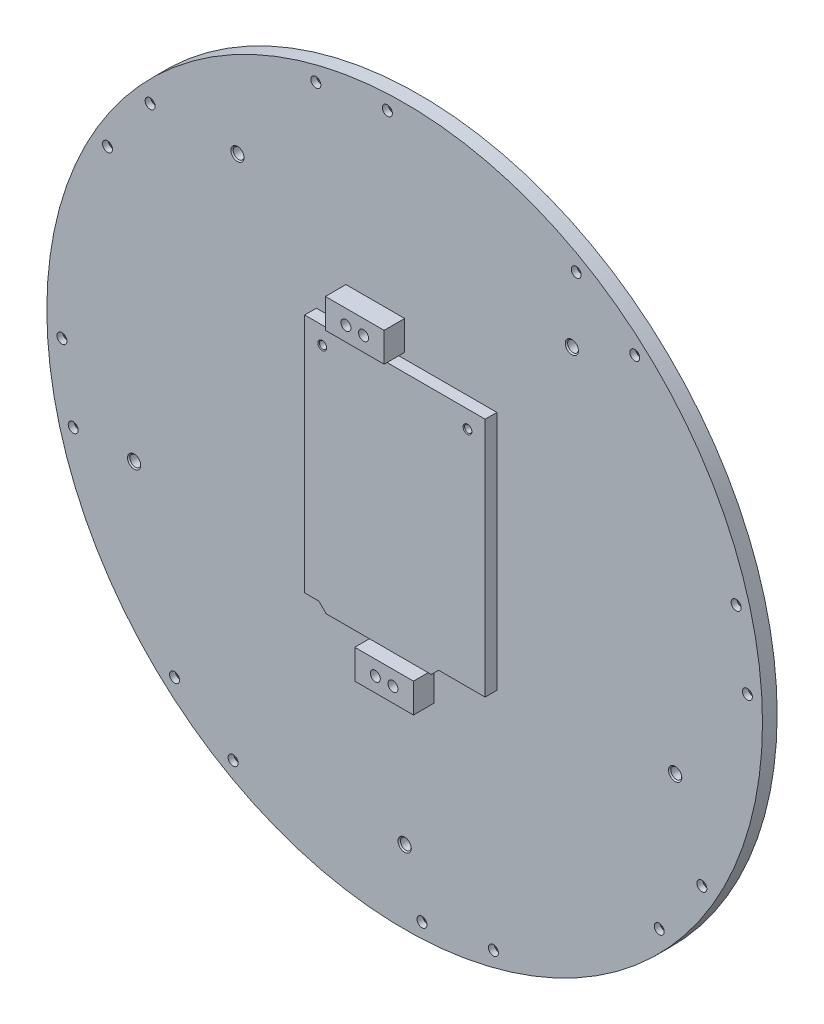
ISO-10303-21;
HEADER;
FILE_DESCRIPTION(('STEP AP214'),'2;1');
FILE_NAME('part.step','',(''),(''),'','','');
FILE_SCHEMA(('AUTOMOTIVE_DESIGN { 1 0 10303 214 1 1 1 1 }'));
ENDSEC;
DATA;
#1=APPLICATION_CONTEXT('core data for automotive mechanical design processes');
#2=APPLICATION_PROTOCOL_DEFINITION('international standard','automotive_design',2000,#1);
#3=PRODUCT_CONTEXT('',#1,'mechanical');
#4=PRODUCT('Part','Part','',(#3));
#5=PRODUCT_RELATED_PRODUCT_CATEGORY('part','',(#4));
#6=PRODUCT_DEFINITION_FORMATION('','',#4);
#7=PRODUCT_DEFINITION_CONTEXT('part definition',#1,'design');
#8=PRODUCT_DEFINITION('design','',#6,#7);
#9=PRODUCT_DEFINITION_SHAPE('','',#8);
#10=(LENGTH_UNIT() NAMED_UNIT(*) SI_UNIT(.MILLI.,.METRE.));
#11=(NAMED_UNIT(*) PLANE_ANGLE_UNIT() SI_UNIT($,.RADIAN.));
#12=(NAMED_UNIT(*) SI_UNIT($,.STERADIAN.) SOLID_ANGLE_UNIT());
#13=UNCERTAINTY_MEASURE_WITH_UNIT(LENGTH_MEASURE(1.E-05),#10,'distance_accuracy_value','');
#14=(GEOMETRIC_REPRESENTATION_CONTEXT(3) GLOBAL_UNCERTAINTY_ASSIGNED_CONTEXT((#13)) GLOBAL_UNIT_ASSIGNED_CONTEXT((#10,
#11,#12)) REPRESENTATION_CONTEXT('',''));
#15=CARTESIAN_POINT('',(0.,0.,0.));
#16=DIRECTION('',(0.,0.,1.));
#17=DIRECTION('',(1.,0.,0.));
#18=AXIS2_PLACEMENT_3D('',#15,#16,#17);
#19=CARTESIAN_POINT('',(0.,0.,5.));
#20=DIRECTION('',(0.,0.,1.));
#21=DIRECTION('',(1.,0.,0.));
#22=AXIS2_PLACEMENT_3D('',#19,#20,#21);
#23=PLANE('',#22);
#24=CARTESIAN_POINT('',(92.1697419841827,-29.9477645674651,5.));
#25=DIRECTION('',(0.,0.,1.));
#26=DIRECTION('',(1.,0.,0.));
#27=AXIS2_PLACEMENT_3D('',#24,#25,#26);
#28=CIRCLE('',#27,2.25);
#29=CARTESIAN_POINT('',(94.4197419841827,-29.9477645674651,5.));
#30=VERTEX_POINT('',#29);
#31=EDGE_CURVE('E579',#30,#30,#28,.T.);
#32=ORIENTED_EDGE('',*,*,#31,.F.);
#33=EDGE_LOOP('',(#32));
#34=FACE_BOUND('',#33,.T.);
#35=CARTESIAN_POINT('',(56.9640332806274,78.4042655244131,5.));
#36=DIRECTION('',(0.,0.,1.));
#37=DIRECTION('',(1.,0.,0.));
#38=AXIS2_PLACEMENT_3D('',#35,#36,#37);
#39=CIRCLE('',#38,2.25);
#40=CARTESIAN_POINT('',(59.2140332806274,78.4042655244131,5.));
#41=VERTEX_POINT('',#40);
#42=EDGE_CURVE('E572',#41,#41,#39,.T.);
#43=ORIENTED_EDGE('',*,*,#42,.F.);
#44=EDGE_LOOP('',(#43));
#45=FACE_BOUND('',#44,.T.);
#46=CARTESIAN_POINT('',(-9.41743454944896E-11,-96.9130019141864,5.));
#47=DIRECTION('',(0.,0.,1.));
#48=DIRECTION('',(1.,0.,0.));
#49=AXIS2_PLACEMENT_3D('',#46,#47,#48);
#50=CIRCLE('',#49,2.25);
#51=CARTESIAN_POINT('',(2.24999999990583,-96.9130019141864,5.));
#52=VERTEX_POINT('',#51);
#53=EDGE_CURVE('E563',#52,#52,#50,.T.);
#54=ORIENTED_EDGE('',*,*,#53,.F.);
#55=EDGE_LOOP('',(#54));
#56=FACE_BOUND('',#55,.T.);
#57=CARTESIAN_POINT('',(-56.9640332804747,78.4042655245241,5.));
#58=DIRECTION('',(0.,0.,1.));
#59=DIRECTION('',(1.,0.,0.));
#60=AXIS2_PLACEMENT_3D('',#57,#58,#59);
#61=CIRCLE('',#60,2.25);
#62=CARTESIAN_POINT('',(-54.7140332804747,78.4042655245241,5.));
#63=VERTEX_POINT('',#62);
#64=EDGE_CURVE('E554',#63,#63,#61,.T.);
#65=ORIENTED_EDGE('',*,*,#64,.F.);
#66=EDGE_LOOP('',(#65));
#67=FACE_BOUND('',#66,.T.);
#68=CARTESIAN_POINT('',(-92.1697419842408,-29.9477645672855,5.));
#69=DIRECTION('',(0.,0.,1.));
#70=DIRECTION('',(1.,0.,0.));
#71=AXIS2_PLACEMENT_3D('',#68,#69,#70);
#72=CIRCLE('',#71,2.25);
#73=CARTESIAN_POINT('',(-89.9197419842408,-29.9477645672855,5.));
#74=VERTEX_POINT('',#73);
#75=EDGE_CURVE('E545',#74,#74,#72,.T.);
#76=ORIENTED_EDGE('',*,*,#75,.F.);
#77=EDGE_LOOP('',(#76));
#78=FACE_BOUND('',#77,.T.);
#79=CARTESIAN_POINT('',(116.764319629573,5.89437681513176,5.));
#80=DIRECTION('',(0.,0.,1.));
#81=DIRECTION('',(1.,0.,0.));
#82=AXIS2_PLACEMENT_3D('',#79,#80,#81);
#83=CIRCLE('',#82,1.7);
#84=CARTESIAN_POINT('',(118.464319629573,5.89437681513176,5.));
#85=VERTEX_POINT('',#84);
#86=EDGE_CURVE('E534',#85,#85,#83,.T.);
#87=ORIENTED_EDGE('',*,*,#86,.F.);
#88=EDGE_LOOP('',(#87));
#89=FACE_BOUND('',#88,.T.);
#90=CARTESIAN_POINT('',(112.929287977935,30.2593115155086,5.));
#91=DIRECTION('',(0.,0.,1.));
#92=DIRECTION('',(1.,0.,0.));
#93=AXIS2_PLACEMENT_3D('',#90,#91,#92);
#94=CIRCLE('',#93,1.7);
#95=CARTESIAN_POINT('',(114.629287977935,30.2593115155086,5.));
#96=VERTEX_POINT('',#95);
#97=EDGE_CURVE('E528',#96,#96,#94,.T.);
#98=ORIENTED_EDGE('',*,*,#97,.F.);
#99=EDGE_LOOP('',(#98));
#100=FACE_BOUND('',#99,.T.);
#101=CARTESIAN_POINT('',(101.249629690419,-58.4565009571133,5.));
#102=DIRECTION('',(0.,0.,1.));
#103=DIRECTION('',(1.,0.,0.));
#104=AXIS2_PLACEMENT_3D('',#101,#102,#103);
#105=CIRCLE('',#104,1.7);
#106=CARTESIAN_POINT('',(102.949629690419,-58.4565009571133,5.));
#107=VERTEX_POINT('',#106);
#108=EDGE_CURVE('E522',#107,#107,#105,.T.);
#109=ORIENTED_EDGE('',*,*,#108,.F.);
#110=EDGE_LOOP('',(#109));
#111=FACE_BOUND('',#110,.T.);
#112=CARTESIAN_POINT('',(86.7327960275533,-78.3968883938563,5.));
#113=DIRECTION('',(0.,0.,1.));
#114=DIRECTION('',(1.,0.,0.));
#115=AXIS2_PLACEMENT_3D('',#112,#113,#114);
#116=CIRCLE('',#115,1.7);
#117=CARTESIAN_POINT('',(88.4327960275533,-78.3968883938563,5.));
#118=VERTEX_POINT('',#117);
#119=EDGE_CURVE('E516',#118,#118,#116,.T.);
#120=ORIENTED_EDGE('',*,*,#119,.F.);
#121=EDGE_LOOP('',(#120));
#122=FACE_BOUND('',#121,.T.);
#123=CARTESIAN_POINT('',(78.3968883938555,86.7327960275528,5.));
#124=DIRECTION('',(0.,0.,1.));
#125=DIRECTION('',(1.,0.,0.));
#126=AXIS2_PLACEMENT_3D('',#123,#124,#125);
#127=CIRCLE('',#126,1.7);
#128=CARTESIAN_POINT('',(80.0968883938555,86.7327960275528,5.));
#129=VERTEX_POINT('',#128);
#130=EDGE_CURVE('E510',#129,#129,#127,.T.);
#131=ORIENTED_EDGE('',*,*,#130,.F.);
#132=EDGE_LOOP('',(#131));
#133=FACE_BOUND('',#132,.T.);
#134=CARTESIAN_POINT('',(58.4565009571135,101.249629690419,5.));
#135=DIRECTION('',(0.,0.,1.));
#136=DIRECTION('',(1.,0.,0.));
#137=AXIS2_PLACEMENT_3D('',#134,#135,#136);
#138=CIRCLE('',#137,1.7);
#139=CARTESIAN_POINT('',(60.1565009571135,101.249629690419,5.));
#140=VERTEX_POINT('',#139);
#141=EDGE_CURVE('E504',#140,#140,#138,.T.);
#142=ORIENTED_EDGE('',*,*,#141,.F.);
#143=EDGE_LOOP('',(#142));
#144=FACE_BOUND('',#143,.T.);
#145=CARTESIAN_POINT('',(30.2593115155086,-112.929287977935,5.));
#146=DIRECTION('',(0.,0.,1.));
#147=DIRECTION('',(1.,0.,0.));
#148=AXIS2_PLACEMENT_3D('',#145,#146,#147);
#149=CIRCLE('',#148,1.7);
#150=CARTESIAN_POINT('',(31.9593115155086,-112.929287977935,5.));
#151=VERTEX_POINT('',#150);
#152=EDGE_CURVE('E498',#151,#151,#149,.T.);
#153=ORIENTED_EDGE('',*,*,#152,.F.);
#154=EDGE_LOOP('',(#153));
#155=FACE_BOUND('',#154,.T.);
#156=CARTESIAN_POINT('',(5.89437681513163,-116.764319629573,5.));
#157=DIRECTION('',(0.,0.,1.));
#158=DIRECTION('',(1.,0.,0.));
#159=AXIS2_PLACEMENT_3D('',#156,#157,#158);
#160=CIRCLE('',#159,1.7);
#161=CARTESIAN_POINT('',(7.59437681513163,-116.764319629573,5.));
#162=VERTEX_POINT('',#161);
#163=EDGE_CURVE('E492',#162,#162,#160,.T.);
#164=ORIENTED_EDGE('',*,*,#163,.F.);
#165=EDGE_LOOP('',(#164));
#166=FACE_BOUND('',#165,.T.);
#167=CARTESIAN_POINT('',(-5.89437681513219,116.764319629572,5.));
#168=DIRECTION('',(0.,0.,1.));
#169=DIRECTION('',(1.,0.,0.));
#170=AXIS2_PLACEMENT_3D('',#167,#168,#169);
#171=CIRCLE('',#170,1.7);
#172=CARTESIAN_POINT('',(-4.19437681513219,116.764319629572,5.));
#173=VERTEX_POINT('',#172);
#174=EDGE_CURVE('E486',#173,#173,#171,.T.);
#175=ORIENTED_EDGE('',*,*,#174,.F.);
#176=EDGE_LOOP('',(#175));
#177=FACE_BOUND('',#176,.T.);
#178=CARTESIAN_POINT('',(-30.2593115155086,112.929287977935,5.));
#179=DIRECTION('',(0.,0.,1.));
#180=DIRECTION('',(1.,0.,0.));
#181=AXIS2_PLACEMENT_3D('',#178,#179,#180);
#182=CIRCLE('',#181,1.7);
#183=CARTESIAN_POINT('',(-28.5593115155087,112.929287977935,5.));
#184=VERTEX_POINT('',#183);
#185=EDGE_CURVE('E480',#184,#184,#182,.T.);
#186=ORIENTED_EDGE('',*,*,#185,.F.);
#187=EDGE_LOOP('',(#186));
#188=FACE_BOUND('',#187,.T.);
#189=CARTESIAN_POINT('',(-58.4565009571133,-101.249629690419,5.));
#190=DIRECTION('',(0.,0.,1.));
#191=DIRECTION('',(1.,0.,0.));
#192=AXIS2_PLACEMENT_3D('',#189,#190,#191);
#193=CIRCLE('',#192,1.7);
#194=CARTESIAN_POINT('',(-56.7565009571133,-101.249629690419,5.));
#195=VERTEX_POINT('',#194);
#196=EDGE_CURVE('E474',#195,#195,#193,.T.);
#197=ORIENTED_EDGE('',*,*,#196,.F.);
#198=EDGE_LOOP('',(#197));
#199=FACE_BOUND('',#198,.T.);
#200=CARTESIAN_POINT('',(-78.3968883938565,-86.7327960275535,5.));
#201=DIRECTION('',(0.,0.,1.));
#202=DIRECTION('',(1.,0.,0.));
#203=AXIS2_PLACEMENT_3D('',#200,#201,#202);
#204=CIRCLE('',#203,1.7);
#205=CARTESIAN_POINT('',(-76.6968883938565,-86.7327960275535,5.));
#206=VERTEX_POINT('',#205);
#207=EDGE_CURVE('E468',#206,#206,#204,.T.);
#208=ORIENTED_EDGE('',*,*,#207,.F.);
#209=EDGE_LOOP('',(#208));
#210=FACE_BOUND('',#209,.T.);
#211=CARTESIAN_POINT('',(-86.7327960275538,78.3968883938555,5.));
#212=DIRECTION('',(0.,0.,1.));
#213=DIRECTION('',(1.,0.,0.));
#214=AXIS2_PLACEMENT_3D('',#211,#212,#213);
#215=CIRCLE('',#214,1.7);
#216=CARTESIAN_POINT('',(-85.0327960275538,78.3968883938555,5.));
#217=VERTEX_POINT('',#216);
#218=EDGE_CURVE('E462',#217,#217,#215,.T.);
#219=ORIENTED_EDGE('',*,*,#218,.F.);
#220=EDGE_LOOP('',(#219));
#221=FACE_BOUND('',#220,.T.);
#222=CARTESIAN_POINT('',(-101.249629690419,58.4565009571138,5.));
#223=DIRECTION('',(0.,0.,1.));
#224=DIRECTION('',(1.,0.,0.));
#225=AXIS2_PLACEMENT_3D('',#222,#223,#224);
#226=CIRCLE('',#225,1.7);
#227=CARTESIAN_POINT('',(-99.5496296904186,58.4565009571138,5.));
#228=VERTEX_POINT('',#227);
#229=EDGE_CURVE('E456',#228,#228,#226,.T.);
#230=ORIENTED_EDGE('',*,*,#229,.F.);
#231=EDGE_LOOP('',(#230));
#232=FACE_BOUND('',#231,.T.);
#233=CARTESIAN_POINT('',(-112.929287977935,-30.2593115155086,5.));
#234=DIRECTION('',(0.,0.,1.));
#235=DIRECTION('',(1.,0.,0.));
#236=AXIS2_PLACEMENT_3D('',#233,#234,#235);
#237=CIRCLE('',#236,1.7);
#238=CARTESIAN_POINT('',(-111.229287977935,-30.2593115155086,5.));
#239=VERTEX_POINT('',#238);
#240=EDGE_CURVE('E450',#239,#239,#237,.T.);
#241=ORIENTED_EDGE('',*,*,#240,.F.);
#242=EDGE_LOOP('',(#241));
#243=FACE_BOUND('',#242,.T.);
#244=CARTESIAN_POINT('',(-116.764319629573,-5.89437681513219,5.));
#245=DIRECTION('',(0.,0.,1.));
#246=DIRECTION('',(1.,0.,0.));
#247=AXIS2_PLACEMENT_3D('',#244,#245,#246);
#248=CIRCLE('',#247,1.7);
#249=CARTESIAN_POINT('',(-115.064319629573,-5.89437681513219,5.));
#250=VERTEX_POINT('',#249);
#251=EDGE_CURVE('E445',#250,#250,#248,.T.);
#252=ORIENTED_EDGE('',*,*,#251,.F.);
#253=EDGE_LOOP('',(#252));
#254=FACE_BOUND('',#253,.T.);
#255=DIRECTION('',(1.,0.,0.));
#256=VECTOR('',#255,1.);
#257=CARTESIAN_POINT('',(-22.7399213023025,-38.1499999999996,5.));
#258=LINE('',#257,#256);
#259=CARTESIAN_POINT('',(-22.7399213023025,-38.1499999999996,5.));
#260=VERTEX_POINT('',#259);
#261=CARTESIAN_POINT('',(13.0737871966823,-38.1499999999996,5.));
#262=VERTEX_POINT('',#261);
#263=EDGE_CURVE('E341',#260,#262,#258,.T.);
#264=ORIENTED_EDGE('',*,*,#263,.F.);
#265=DIRECTION('',(0.707106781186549,-0.707106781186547,0.));
#266=VECTOR('',#265,1.);
#267=CARTESIAN_POINT('',(-25.2399213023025,-35.6499999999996,5.));
#268=LINE('',#267,#266);
#269=CARTESIAN_POINT('',(-25.2399213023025,-35.6499999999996,5.));
#270=VERTEX_POINT('',#269);
#271=EDGE_CURVE('E319',#270,#260,#268,.T.);
#272=ORIENTED_EDGE('',*,*,#271,.F.);
#273=DIRECTION('',(1.,0.,0.));
#274=VECTOR('',#273,1.);
#275=CARTESIAN_POINT('',(-30.0830670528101,-35.6499999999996,5.));
#276=LINE('',#275,#274);
#277=CARTESIAN_POINT('',(-30.0830670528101,-35.6499999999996,5.));
#278=VERTEX_POINT('',#277);
#279=EDGE_CURVE('E365',#278,#270,#276,.T.);
#280=ORIENTED_EDGE('',*,*,#279,.F.);
#281=DIRECTION('',(0.,-1.,0.));
#282=VECTOR('',#281,1.);
#283=CARTESIAN_POINT('',(-30.0830670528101,46.35,5.));
#284=LINE('',#283,#282);
#285=CARTESIAN_POINT('',(-30.0830670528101,46.35,5.));
#286=VERTEX_POINT('',#285);
#287=EDGE_CURVE('E361',#286,#278,#284,.T.);
#288=ORIENTED_EDGE('',*,*,#287,.F.);
#289=DIRECTION('',(-1.,0.,0.));
#290=VECTOR('',#289,1.);
#291=CARTESIAN_POINT('',(31.4169329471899,46.35,5.));
#292=LINE('',#291,#290);
#293=CARTESIAN_POINT('',(31.4169329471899,46.35,5.));
#294=VERTEX_POINT('',#293);
#295=EDGE_CURVE('E357',#294,#286,#292,.T.);
#296=ORIENTED_EDGE('',*,*,#295,.F.);
#297=DIRECTION('',(0.,1.,0.));
#298=VECTOR('',#297,1.);
#299=CARTESIAN_POINT('',(31.4169329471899,-35.6499999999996,5.));
#300=LINE('',#299,#298);
#301=CARTESIAN_POINT('',(31.4169329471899,-35.6499999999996,5.));
#302=VERTEX_POINT('',#301);
#303=EDGE_CURVE('E353',#302,#294,#300,.T.);
#304=ORIENTED_EDGE('',*,*,#303,.F.);
#305=DIRECTION('',(1.,0.,0.));
#306=VECTOR('',#305,1.);
#307=CARTESIAN_POINT('',(15.5737871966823,-35.6499999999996,5.));
#308=LINE('',#307,#306);
#309=CARTESIAN_POINT('',(15.5737871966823,-35.6499999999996,5.));
#310=VERTEX_POINT('',#309);
#311=EDGE_CURVE('E349',#310,#302,#308,.T.);
#312=ORIENTED_EDGE('',*,*,#311,.F.);
#313=DIRECTION('',(0.707106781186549,0.707106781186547,0.));
#314=VECTOR('',#313,1.);
#315=CARTESIAN_POINT('',(13.0737871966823,-38.1499999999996,5.));
#316=LINE('',#315,#314);
#317=EDGE_CURVE('E345',#262,#310,#316,.T.);
#318=ORIENTED_EDGE('',*,*,#317,.F.);
#319=EDGE_LOOP('',(#264,#272,#280,#288,#296,#304,#312,#318));
#320=FACE_BOUND('',#319,.T.);
#321=CARTESIAN_POINT('',(0.,0.,5.));
#322=DIRECTION('',(0.,0.,1.));
#323=DIRECTION('',(1.,0.,0.));
#324=AXIS2_PLACEMENT_3D('',#321,#322,#323);
#325=CIRCLE('',#324,121.91238);
#326=CARTESIAN_POINT('',(121.91238,0.,5.));
#327=VERTEX_POINT('',#326);
#328=EDGE_CURVE('E404',#327,#327,#325,.T.);
#329=ORIENTED_EDGE('',*,*,#328,.T.);
#330=EDGE_LOOP('',(#329));
#331=FACE_BOUND('',#330,.T.);
#332=DIRECTION('',(1.,0.,0.));
#333=VECTOR('',#332,1.);
#334=CARTESIAN_POINT('',(-20.0101400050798,48.35,5.));
#335=LINE('',#334,#333);
#336=CARTESIAN_POINT('',(-20.0101400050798,48.35,5.));
#337=VERTEX_POINT('',#336);
#338=CARTESIAN_POINT('',(-0.0101400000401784,48.35,5.));
#339=VERTEX_POINT('',#338);
#340=EDGE_CURVE('E282',#337,#339,#335,.T.);
#341=ORIENTED_EDGE('',*,*,#340,.F.);
#342=DIRECTION('',(0.,-1.,0.));
#343=VECTOR('',#342,1.);
#344=CARTESIAN_POINT('',(-20.0101400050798,58.3499999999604,5.));
#345=LINE('',#344,#343);
#346=CARTESIAN_POINT('',(-20.0101400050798,58.3499999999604,5.));
#347=VERTEX_POINT('',#346);
#348=EDGE_CURVE('E278',#347,#337,#345,.T.);
#349=ORIENTED_EDGE('',*,*,#348,.F.);
#350=DIRECTION('',(-1.,0.,0.));
#351=VECTOR('',#350,1.);
#352=CARTESIAN_POINT('',(-0.0101400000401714,58.3499999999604,5.));
#353=LINE('',#352,#351);
#354=CARTESIAN_POINT('',(-0.010140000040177,58.3499999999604,5.));
#355=VERTEX_POINT('',#354);
#356=EDGE_CURVE('E268',#355,#347,#353,.T.);
#357=ORIENTED_EDGE('',*,*,#356,.F.);
#358=DIRECTION('',(0.,1.,0.));
#359=VECTOR('',#358,1.);
#360=CARTESIAN_POINT('',(-0.010140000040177,48.35,5.));
#361=LINE('',#360,#359);
#362=EDGE_CURVE('E285',#339,#355,#361,.T.);
#363=ORIENTED_EDGE('',*,*,#362,.F.);
#364=EDGE_LOOP('',(#341,#349,#357,#363));
#365=FACE_BOUND('',#364,.T.);
#366=DIRECTION('',(1.,0.,0.));
#367=VECTOR('',#366,1.);
#368=CARTESIAN_POINT('',(-10.00000000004,-50.1499999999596,5.));
#369=LINE('',#368,#367);
#370=CARTESIAN_POINT('',(-10.00000000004,-50.1499999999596,5.));
#371=VERTEX_POINT('',#370);
#372=CARTESIAN_POINT('',(9.99999999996,-50.1499999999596,5.));
#373=VERTEX_POINT('',#372);
#374=EDGE_CURVE('E239',#371,#373,#369,.T.);
#375=ORIENTED_EDGE('',*,*,#374,.F.);
#376=DIRECTION('',(0.,-1.,0.));
#377=VECTOR('',#376,1.);
#378=CARTESIAN_POINT('',(-10.00000000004,-40.1499999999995,5.));
#379=LINE('',#378,#377);
#380=CARTESIAN_POINT('',(-10.00000000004,-40.1499999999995,5.));
#381=VERTEX_POINT('',#380);
#382=EDGE_CURVE('E235',#381,#371,#379,.T.);
#383=ORIENTED_EDGE('',*,*,#382,.F.);
#384=DIRECTION('',(-1.,0.,0.));
#385=VECTOR('',#384,1.);
#386=CARTESIAN_POINT('',(9.99999999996,-40.1499999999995,5.));
#387=LINE('',#386,#385);
#388=CARTESIAN_POINT('',(9.99999999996,-40.1499999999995,5.));
#389=VERTEX_POINT('',#388);
#390=EDGE_CURVE('E225',#389,#381,#387,.T.);
#391=ORIENTED_EDGE('',*,*,#390,.F.);
#392=DIRECTION('',(0.,1.,0.));
#393=VECTOR('',#392,1.);
#394=CARTESIAN_POINT('',(9.99999999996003,-50.1499999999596,5.));
#395=LINE('',#394,#393);
#396=EDGE_CURVE('E243',#373,#389,#395,.T.);
#397=ORIENTED_EDGE('',*,*,#396,.F.);
#398=EDGE_LOOP('',(#375,#383,#391,#397));
#399=FACE_BOUND('',#398,.T.);
#400=ADVANCED_FACE('F17',(#34,#45,#56,#67,#78,#89,#100,#111,#122,#133,#144,#155,#166,#177,#188,
#199,#210,#221,#232,#243,#254,#320,#331,#365,#399),#23,.T.);
#401=CARTESIAN_POINT('',(0.,0.,5.));
#402=DIRECTION('',(0.,0.,-1.));
#403=DIRECTION('',(-1.,0.,0.));
#404=AXIS2_PLACEMENT_3D('',#401,#402,#403);
#405=CYLINDRICAL_SURFACE('',#404,121.91238);
#406=ORIENTED_EDGE('',*,*,#328,.F.);
#407=EDGE_LOOP('',(#406));
#408=FACE_BOUND('',#407,.T.);
#409=CARTESIAN_POINT('',(0.,0.,0.));
#410=DIRECTION('',(0.,0.,1.));
#411=DIRECTION('',(1.,0.,0.));
#412=AXIS2_PLACEMENT_3D('',#409,#410,#411);
#413=CIRCLE('',#412,121.91238);
#414=CARTESIAN_POINT('',(121.91238,0.,0.));
#415=VERTEX_POINT('',#414);
#416=EDGE_CURVE('E400',#415,#415,#413,.T.);
#417=ORIENTED_EDGE('',*,*,#416,.T.);
#418=EDGE_LOOP('',(#417));
#419=FACE_BOUND('',#418,.T.);
#420=ADVANCED_FACE('F19',(#408,#419),#405,.T.);
#421=CARTESIAN_POINT('',(0.,0.,0.));
#422=DIRECTION('',(0.,0.,1.));
#423=DIRECTION('',(1.,0.,0.));
#424=AXIS2_PLACEMENT_3D('',#421,#422,#423);
#425=PLANE('',#424);
#426=CARTESIAN_POINT('',(92.1697419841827,-29.9477645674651,0.));
#427=DIRECTION('',(0.,0.,1.));
#428=DIRECTION('',(1.,0.,0.));
#429=AXIS2_PLACEMENT_3D('',#426,#427,#428);
#430=CIRCLE('',#429,1.85);
#431=CARTESIAN_POINT('',(94.0197419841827,-29.9477645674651,0.));
#432=VERTEX_POINT('',#431);
#433=EDGE_CURVE('E576',#432,#432,#430,.T.);
#434=ORIENTED_EDGE('',*,*,#433,.T.);
#435=EDGE_LOOP('',(#434));
#436=FACE_BOUND('',#435,.T.);
#437=CARTESIAN_POINT('',(56.9640332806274,78.4042655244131,0.));
#438=DIRECTION('',(0.,0.,1.));
#439=DIRECTION('',(1.,0.,0.));
#440=AXIS2_PLACEMENT_3D('',#437,#438,#439);
#441=CIRCLE('',#440,1.85);
#442=CARTESIAN_POINT('',(58.8140332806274,78.4042655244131,0.));
#443=VERTEX_POINT('',#442);
#444=EDGE_CURVE('E568',#443,#443,#441,.T.);
#445=ORIENTED_EDGE('',*,*,#444,.T.);
#446=EDGE_LOOP('',(#445));
#447=FACE_BOUND('',#446,.T.);
#448=CARTESIAN_POINT('',(-9.41743454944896E-11,-96.9130019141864,0.));
#449=DIRECTION('',(0.,0.,1.));
#450=DIRECTION('',(1.,0.,0.));
#451=AXIS2_PLACEMENT_3D('',#448,#449,#450);
#452=CIRCLE('',#451,1.85);
#453=CARTESIAN_POINT('',(1.84999999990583,-96.9130019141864,0.));
#454=VERTEX_POINT('',#453);
#455=EDGE_CURVE('E559',#454,#454,#452,.T.);
#456=ORIENTED_EDGE('',*,*,#455,.T.);
#457=EDGE_LOOP('',(#456));
#458=FACE_BOUND('',#457,.T.);
#459=CARTESIAN_POINT('',(-56.9640332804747,78.4042655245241,0.));
#460=DIRECTION('',(0.,0.,1.));
#461=DIRECTION('',(1.,0.,0.));
#462=AXIS2_PLACEMENT_3D('',#459,#460,#461);
#463=CIRCLE('',#462,1.85);
#464=CARTESIAN_POINT('',(-55.1140332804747,78.4042655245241,0.));
#465=VERTEX_POINT('',#464);
#466=EDGE_CURVE('E550',#465,#465,#463,.T.);
#467=ORIENTED_EDGE('',*,*,#466,.T.);
#468=EDGE_LOOP('',(#467));
#469=FACE_BOUND('',#468,.T.);
#470=CARTESIAN_POINT('',(-92.1697419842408,-29.9477645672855,0.));
#471=DIRECTION('',(0.,0.,1.));
#472=DIRECTION('',(1.,0.,0.));
#473=AXIS2_PLACEMENT_3D('',#470,#471,#472);
#474=CIRCLE('',#473,1.85);
#475=CARTESIAN_POINT('',(-90.3197419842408,-29.9477645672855,0.));
#476=VERTEX_POINT('',#475);
#477=EDGE_CURVE('E540',#476,#476,#474,.T.);
#478=ORIENTED_EDGE('',*,*,#477,.T.);
#479=EDGE_LOOP('',(#478));
#480=FACE_BOUND('',#479,.T.);
#481=CARTESIAN_POINT('',(116.764319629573,5.89437681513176,0.));
#482=DIRECTION('',(0.,0.,1.));
#483=DIRECTION('',(1.,0.,0.));
#484=AXIS2_PLACEMENT_3D('',#481,#482,#483);
#485=CIRCLE('',#484,3.5);
#486=CARTESIAN_POINT('',(120.264319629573,5.89437681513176,0.));
#487=VERTEX_POINT('',#486);
#488=EDGE_CURVE('E544',#487,#487,#485,.T.);
#489=ORIENTED_EDGE('',*,*,#488,.T.);
#490=EDGE_LOOP('',(#489));
#491=FACE_BOUND('',#490,.T.);
#492=CARTESIAN_POINT('',(112.929287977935,30.2593115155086,0.));
#493=DIRECTION('',(0.,0.,1.));
#494=DIRECTION('',(1.,0.,0.));
#495=AXIS2_PLACEMENT_3D('',#492,#493,#494);
#496=CIRCLE('',#495,3.5);
#497=CARTESIAN_POINT('',(116.429287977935,30.2593115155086,0.));
#498=VERTEX_POINT('',#497);
#499=EDGE_CURVE('E538',#498,#498,#496,.T.);
#500=ORIENTED_EDGE('',*,*,#499,.T.);
#501=EDGE_LOOP('',(#500));
#502=FACE_BOUND('',#501,.T.);
#503=CARTESIAN_POINT('',(101.249629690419,-58.4565009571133,0.));
#504=DIRECTION('',(0.,0.,1.));
#505=DIRECTION('',(1.,0.,0.));
#506=AXIS2_PLACEMENT_3D('',#503,#504,#505);
#507=CIRCLE('',#506,3.5);
#508=CARTESIAN_POINT('',(104.749629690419,-58.4565009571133,0.));
#509=VERTEX_POINT('',#508);
#510=EDGE_CURVE('E532',#509,#509,#507,.T.);
#511=ORIENTED_EDGE('',*,*,#510,.T.);
#512=EDGE_LOOP('',(#511));
#513=FACE_BOUND('',#512,.T.);
#514=CARTESIAN_POINT('',(86.7327960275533,-78.3968883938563,0.));
#515=DIRECTION('',(0.,0.,1.));
#516=DIRECTION('',(1.,0.,0.));
#517=AXIS2_PLACEMENT_3D('',#514,#515,#516);
#518=CIRCLE('',#517,3.5);
#519=CARTESIAN_POINT('',(90.2327960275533,-78.3968883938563,0.));
#520=VERTEX_POINT('',#519);
#521=EDGE_CURVE('E526',#520,#520,#518,.T.);
#522=ORIENTED_EDGE('',*,*,#521,.T.);
#523=EDGE_LOOP('',(#522));
#524=FACE_BOUND('',#523,.T.);
#525=CARTESIAN_POINT('',(78.3968883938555,86.7327960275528,0.));
#526=DIRECTION('',(0.,0.,1.));
#527=DIRECTION('',(1.,0.,0.));
#528=AXIS2_PLACEMENT_3D('',#525,#526,#527);
#529=CIRCLE('',#528,3.5);
#530=CARTESIAN_POINT('',(81.8968883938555,86.7327960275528,0.));
#531=VERTEX_POINT('',#530);
#532=EDGE_CURVE('E520',#531,#531,#529,.T.);
#533=ORIENTED_EDGE('',*,*,#532,.T.);
#534=EDGE_LOOP('',(#533));
#535=FACE_BOUND('',#534,.T.);
#536=CARTESIAN_POINT('',(58.4565009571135,101.249629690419,0.));
#537=DIRECTION('',(0.,0.,1.));
#538=DIRECTION('',(1.,0.,0.));
#539=AXIS2_PLACEMENT_3D('',#536,#537,#538);
#540=CIRCLE('',#539,3.5);
#541=CARTESIAN_POINT('',(61.9565009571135,101.249629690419,0.));
#542=VERTEX_POINT('',#541);
#543=EDGE_CURVE('E514',#542,#542,#540,.T.);
#544=ORIENTED_EDGE('',*,*,#543,.T.);
#545=EDGE_LOOP('',(#544));
#546=FACE_BOUND('',#545,.T.);
#547=CARTESIAN_POINT('',(30.2593115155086,-112.929287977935,0.));
#548=DIRECTION('',(0.,0.,1.));
#549=DIRECTION('',(1.,0.,0.));
#550=AXIS2_PLACEMENT_3D('',#547,#548,#549);
#551=CIRCLE('',#550,3.5);
#552=CARTESIAN_POINT('',(33.7593115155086,-112.929287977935,0.));
#553=VERTEX_POINT('',#552);
#554=EDGE_CURVE('E508',#553,#553,#551,.T.);
#555=ORIENTED_EDGE('',*,*,#554,.T.);
#556=EDGE_LOOP('',(#555));
#557=FACE_BOUND('',#556,.T.);
#558=CARTESIAN_POINT('',(5.89437681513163,-116.764319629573,0.));
#559=DIRECTION('',(0.,0.,1.));
#560=DIRECTION('',(1.,0.,0.));
#561=AXIS2_PLACEMENT_3D('',#558,#559,#560);
#562=CIRCLE('',#561,3.5);
#563=CARTESIAN_POINT('',(9.39437681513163,-116.764319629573,0.));
#564=VERTEX_POINT('',#563);
#565=EDGE_CURVE('E502',#564,#564,#562,.T.);
#566=ORIENTED_EDGE('',*,*,#565,.T.);
#567=EDGE_LOOP('',(#566));
#568=FACE_BOUND('',#567,.T.);
#569=CARTESIAN_POINT('',(-5.89437681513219,116.764319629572,0.));
#570=DIRECTION('',(0.,0.,1.));
#571=DIRECTION('',(1.,0.,0.));
#572=AXIS2_PLACEMENT_3D('',#569,#570,#571);
#573=CIRCLE('',#572,3.5);
#574=CARTESIAN_POINT('',(-2.39437681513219,116.764319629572,0.));
#575=VERTEX_POINT('',#574);
#576=EDGE_CURVE('E496',#575,#575,#573,.T.);
#577=ORIENTED_EDGE('',*,*,#576,.T.);
#578=EDGE_LOOP('',(#577));
#579=FACE_BOUND('',#578,.T.);
#580=CARTESIAN_POINT('',(-30.2593115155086,112.929287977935,0.));
#581=DIRECTION('',(0.,0.,1.));
#582=DIRECTION('',(1.,0.,0.));
#583=AXIS2_PLACEMENT_3D('',#580,#581,#582);
#584=CIRCLE('',#583,3.5);
#585=CARTESIAN_POINT('',(-26.7593115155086,112.929287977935,0.));
#586=VERTEX_POINT('',#585);
#587=EDGE_CURVE('E490',#586,#586,#584,.T.);
#588=ORIENTED_EDGE('',*,*,#587,.T.);
#589=EDGE_LOOP('',(#588));
#590=FACE_BOUND('',#589,.T.);
#591=CARTESIAN_POINT('',(-58.4565009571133,-101.249629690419,0.));
#592=DIRECTION('',(0.,0.,1.));
#593=DIRECTION('',(1.,0.,0.));
#594=AXIS2_PLACEMENT_3D('',#591,#592,#593);
#595=CIRCLE('',#594,3.5);
#596=CARTESIAN_POINT('',(-54.9565009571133,-101.249629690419,0.));
#597=VERTEX_POINT('',#596);
#598=EDGE_CURVE('E484',#597,#597,#595,.T.);
#599=ORIENTED_EDGE('',*,*,#598,.T.);
#600=EDGE_LOOP('',(#599));
#601=FACE_BOUND('',#600,.T.);
#602=CARTESIAN_POINT('',(-78.3968883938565,-86.7327960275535,0.));
#603=DIRECTION('',(0.,0.,1.));
#604=DIRECTION('',(1.,0.,0.));
#605=AXIS2_PLACEMENT_3D('',#602,#603,#604);
#606=CIRCLE('',#605,3.5);
#607=CARTESIAN_POINT('',(-74.8968883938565,-86.7327960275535,0.));
#608=VERTEX_POINT('',#607);
#609=EDGE_CURVE('E478',#608,#608,#606,.T.);
#610=ORIENTED_EDGE('',*,*,#609,.T.);
#611=EDGE_LOOP('',(#610));
#612=FACE_BOUND('',#611,.T.);
#613=CARTESIAN_POINT('',(-86.7327960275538,78.3968883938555,0.));
#614=DIRECTION('',(0.,0.,1.));
#615=DIRECTION('',(1.,0.,0.));
#616=AXIS2_PLACEMENT_3D('',#613,#614,#615);
#617=CIRCLE('',#616,3.5);
#618=CARTESIAN_POINT('',(-83.2327960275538,78.3968883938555,0.));
#619=VERTEX_POINT('',#618);
#620=EDGE_CURVE('E472',#619,#619,#617,.T.);
#621=ORIENTED_EDGE('',*,*,#620,.T.);
#622=EDGE_LOOP('',(#621));
#623=FACE_BOUND('',#622,.T.);
#624=CARTESIAN_POINT('',(-101.249629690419,58.4565009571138,0.));
#625=DIRECTION('',(0.,0.,1.));
#626=DIRECTION('',(1.,0.,0.));
#627=AXIS2_PLACEMENT_3D('',#624,#625,#626);
#628=CIRCLE('',#627,3.5);
#629=CARTESIAN_POINT('',(-97.7496296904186,58.4565009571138,0.));
#630=VERTEX_POINT('',#629);
#631=EDGE_CURVE('E466',#630,#630,#628,.T.);
#632=ORIENTED_EDGE('',*,*,#631,.T.);
#633=EDGE_LOOP('',(#632));
#634=FACE_BOUND('',#633,.T.);
#635=CARTESIAN_POINT('',(-112.929287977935,-30.2593115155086,0.));
#636=DIRECTION('',(0.,0.,1.));
#637=DIRECTION('',(1.,0.,0.));
#638=AXIS2_PLACEMENT_3D('',#635,#636,#637);
#639=CIRCLE('',#638,3.5);
#640=CARTESIAN_POINT('',(-109.429287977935,-30.2593115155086,0.));
#641=VERTEX_POINT('',#640);
#642=EDGE_CURVE('E460',#641,#641,#639,.T.);
#643=ORIENTED_EDGE('',*,*,#642,.T.);
#644=EDGE_LOOP('',(#643));
#645=FACE_BOUND('',#644,.T.);
#646=CARTESIAN_POINT('',(-116.764319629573,-5.89437681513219,0.));
#647=DIRECTION('',(0.,0.,1.));
#648=DIRECTION('',(1.,0.,0.));
#649=AXIS2_PLACEMENT_3D('',#646,#647,#648);
#650=CIRCLE('',#649,3.5);
#651=CARTESIAN_POINT('',(-113.264319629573,-5.89437681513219,0.));
#652=VERTEX_POINT('',#651);
#653=EDGE_CURVE('E454',#652,#652,#650,.T.);
#654=ORIENTED_EDGE('',*,*,#653,.T.);
#655=EDGE_LOOP('',(#654));
#656=FACE_BOUND('',#655,.T.);
#657=CARTESIAN_POINT('',(-2.99998000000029,-45.15059,0.));
#658=DIRECTION('',(0.,0.,1.));
#659=DIRECTION('',(1.,0.,0.));
#660=AXIS2_PLACEMENT_3D('',#657,#658,#659);
#661=CIRCLE('',#660,3.5);
#662=CARTESIAN_POINT('',(-2.91433543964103E-13,-43.3477810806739,0.));
#663=VERTEX_POINT('',#662);
#664=CARTESIAN_POINT('',(-2.9316826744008E-13,-46.9533989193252,0.));
#665=VERTEX_POINT('',#664);
#666=EDGE_CURVE('E168',#663,#665,#661,.T.);
#667=ORIENTED_EDGE('',*,*,#666,.T.);
#668=CARTESIAN_POINT('',(2.9999799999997,-45.15059,0.));
#669=DIRECTION('',(0.,0.,1.));
#670=DIRECTION('',(1.,0.,0.));
#671=AXIS2_PLACEMENT_3D('',#668,#669,#670);
#672=CIRCLE('',#671,3.5);
#673=EDGE_CURVE('E35',#665,#663,#672,.T.);
#674=ORIENTED_EDGE('',*,*,#673,.T.);
#675=EDGE_LOOP('',(#667,#674));
#676=FACE_BOUND('',#675,.T.);
#677=CARTESIAN_POINT('',(-13.0000000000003,53.35059,0.));
#678=DIRECTION('',(0.,0.,1.));
#679=DIRECTION('',(1.,0.,0.));
#680=AXIS2_PLACEMENT_3D('',#677,#678,#679);
#681=CIRCLE('',#680,3.5);
#682=CARTESIAN_POINT('',(-10.0051000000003,55.1618254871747,0.));
#683=VERTEX_POINT('',#682);
#684=CARTESIAN_POINT('',(-10.0051000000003,51.5393545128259,0.));
#685=VERTEX_POINT('',#684);
#686=EDGE_CURVE('E203',#683,#685,#681,.T.);
#687=ORIENTED_EDGE('',*,*,#686,.T.);
#688=CARTESIAN_POINT('',(-7.01020000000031,53.35059,0.));
#689=DIRECTION('',(0.,0.,1.));
#690=DIRECTION('',(1.,0.,0.));
#691=AXIS2_PLACEMENT_3D('',#688,#689,#690);
#692=CIRCLE('',#691,3.5);
#693=EDGE_CURVE('E43',#685,#683,#692,.T.);
#694=ORIENTED_EDGE('',*,*,#693,.T.);
#695=EDGE_LOOP('',(#687,#694));
#696=FACE_BOUND('',#695,.T.);
#697=CARTESIAN_POINT('',(25.4169329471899,40.35,0.));
#698=DIRECTION('',(0.,0.,1.));
#699=DIRECTION('',(1.,0.,0.));
#700=AXIS2_PLACEMENT_3D('',#697,#698,#699);
#701=CIRCLE('',#700,1.25);
#702=CARTESIAN_POINT('',(26.6669329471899,40.35,0.));
#703=VERTEX_POINT('',#702);
#704=EDGE_CURVE('E307',#703,#703,#701,.T.);
#705=ORIENTED_EDGE('',*,*,#704,.T.);
#706=EDGE_LOOP('',(#705));
#707=FACE_BOUND('',#706,.T.);
#708=CARTESIAN_POINT('',(-24.0830670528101,40.35,0.));
#709=DIRECTION('',(0.,0.,1.));
#710=DIRECTION('',(1.,0.,0.));
#711=AXIS2_PLACEMENT_3D('',#708,#709,#710);
#712=CIRCLE('',#711,1.25);
#713=CARTESIAN_POINT('',(-22.8330670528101,40.35,0.));
#714=VERTEX_POINT('',#713);
#715=EDGE_CURVE('E312',#714,#714,#712,.T.);
#716=ORIENTED_EDGE('',*,*,#715,.T.);
#717=EDGE_LOOP('',(#716));
#718=FACE_BOUND('',#717,.T.);
#719=ORIENTED_EDGE('',*,*,#416,.F.);
#720=EDGE_LOOP('',(#719));
#721=FACE_BOUND('',#720,.T.);
#722=ADVANCED_FACE('F859',(#436,#447,#458,#469,#480,#491,#502,#513,#524,#535,#546,#557,#568,
#579,#590,#601,#612,#623,#634,#645,#656,#676,#696,#707,#718,#721),#425,.F.);
#723=CARTESIAN_POINT('',(-22.7399213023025,-38.1499999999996,9.));
#724=DIRECTION('',(0.,1.,0.));
#725=DIRECTION('',(0.,0.,1.));
#726=AXIS2_PLACEMENT_3D('',#723,#724,#725);
#727=PLANE('',#726);
#728=ORIENTED_EDGE('',*,*,#263,.T.);
#729=DIRECTION('',(0.,0.,-1.));
#730=VECTOR('',#729,1.);
#731=CARTESIAN_POINT('',(13.0737871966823,-38.1499999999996,9.));
#732=LINE('',#731,#730);
#733=CARTESIAN_POINT('',(13.0737871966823,-38.1499999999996,9.));
#734=VERTEX_POINT('',#733);
#735=EDGE_CURVE('E396',#734,#262,#732,.T.);
#736=ORIENTED_EDGE('',*,*,#735,.F.);
#737=DIRECTION('',(1.,0.,0.));
#738=VECTOR('',#737,1.);
#739=CARTESIAN_POINT('',(-22.7399213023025,-38.1499999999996,9.));
#740=LINE('',#739,#738);
#741=CARTESIAN_POINT('',(-22.7399213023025,-38.1499999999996,9.));
#742=VERTEX_POINT('',#741);
#743=EDGE_CURVE('E314',#742,#734,#740,.T.);
#744=ORIENTED_EDGE('',*,*,#743,.F.);
#745=DIRECTION('',(0.,0.,-1.));
#746=VECTOR('',#745,1.);
#747=CARTESIAN_POINT('',(-22.7399213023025,-38.1499999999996,9.));
#748=LINE('',#747,#746);
#749=EDGE_CURVE('E340',#742,#260,#748,.T.);
#750=ORIENTED_EDGE('',*,*,#749,.T.);
#751=EDGE_LOOP('',(#728,#736,#744,#750));
#752=FACE_BOUND('',#751,.T.);
#753=ADVANCED_FACE('F863',(#752),#727,.F.);
#754=CARTESIAN_POINT('',(13.0737871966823,-38.1499999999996,9.));
#755=DIRECTION('',(-0.707106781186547,0.707106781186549,0.));
#756=DIRECTION('',(-0.707106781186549,-0.707106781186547,0.));
#757=AXIS2_PLACEMENT_3D('',#754,#755,#756);
#758=PLANE('',#757);
#759=ORIENTED_EDGE('',*,*,#317,.T.);
#760=DIRECTION('',(0.,0.,-1.));
#761=VECTOR('',#760,1.);
#762=CARTESIAN_POINT('',(15.5737871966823,-35.6499999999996,9.));
#763=LINE('',#762,#761);
#764=CARTESIAN_POINT('',(15.5737871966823,-35.6499999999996,9.));
#765=VERTEX_POINT('',#764);
#766=EDGE_CURVE('E392',#765,#310,#763,.T.);
#767=ORIENTED_EDGE('',*,*,#766,.F.);
#768=DIRECTION('',(0.707106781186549,0.707106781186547,0.));
#769=VECTOR('',#768,1.);
#770=CARTESIAN_POINT('',(13.0737871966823,-38.1499999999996,9.));
#771=LINE('',#770,#769);
#772=EDGE_CURVE('E318',#734,#765,#771,.T.);
#773=ORIENTED_EDGE('',*,*,#772,.F.);
#774=ORIENTED_EDGE('',*,*,#735,.T.);
#775=EDGE_LOOP('',(#759,#767,#773,#774));
#776=FACE_BOUND('',#775,.T.);
#777=ADVANCED_FACE('F869',(#776),#758,.F.);
#778=CARTESIAN_POINT('',(15.5737871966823,-35.6499999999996,9.));
#779=DIRECTION('',(0.,1.,0.));
#780=DIRECTION('',(0.,0.,1.));
#781=AXIS2_PLACEMENT_3D('',#778,#779,#780);
#782=PLANE('',#781);
#783=ORIENTED_EDGE('',*,*,#311,.T.);
#784=DIRECTION('',(0.,0.,-1.));
#785=VECTOR('',#784,1.);
#786=CARTESIAN_POINT('',(31.4169329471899,-35.6499999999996,9.));
#787=LINE('',#786,#785);
#788=CARTESIAN_POINT('',(31.4169329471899,-35.6499999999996,9.));
#789=VERTEX_POINT('',#788);
#790=EDGE_CURVE('E388',#789,#302,#787,.T.);
#791=ORIENTED_EDGE('',*,*,#790,.F.);
#792=DIRECTION('',(1.,0.,0.));
#793=VECTOR('',#792,1.);
#794=CARTESIAN_POINT('',(15.5737871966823,-35.6499999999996,9.));
#795=LINE('',#794,#793);
#796=EDGE_CURVE('E322',#765,#789,#795,.T.);
#797=ORIENTED_EDGE('',*,*,#796,.F.);
#798=ORIENTED_EDGE('',*,*,#766,.T.);
#799=EDGE_LOOP('',(#783,#791,#797,#798));
#800=FACE_BOUND('',#799,.T.);
#801=ADVANCED_FACE('F958',(#800),#782,.F.);
#802=CARTESIAN_POINT('',(31.4169329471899,-35.6499999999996,9.));
#803=DIRECTION('',(-1.,0.,0.));
#804=DIRECTION('',(0.,0.,1.));
#805=AXIS2_PLACEMENT_3D('',#802,#803,#804);
#806=PLANE('',#805);
#807=ORIENTED_EDGE('',*,*,#303,.T.);
#808=DIRECTION('',(0.,0.,-1.));
#809=VECTOR('',#808,1.);
#810=CARTESIAN_POINT('',(31.4169329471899,46.35,9.));
#811=LINE('',#810,#809);
#812=CARTESIAN_POINT('',(31.4169329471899,46.35,9.));
#813=VERTEX_POINT('',#812);
#814=EDGE_CURVE('E384',#813,#294,#811,.T.);
#815=ORIENTED_EDGE('',*,*,#814,.F.);
#816=DIRECTION('',(0.,1.,0.));
#817=VECTOR('',#816,1.);
#818=CARTESIAN_POINT('',(31.4169329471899,-35.6499999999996,9.));
#819=LINE('',#818,#817);
#820=EDGE_CURVE('E325',#789,#813,#819,.T.);
#821=ORIENTED_EDGE('',*,*,#820,.F.);
#822=ORIENTED_EDGE('',*,*,#790,.T.);
#823=EDGE_LOOP('',(#807,#815,#821,#822));
#824=FACE_BOUND('',#823,.T.);
#825=ADVANCED_FACE('F954',(#824),#806,.F.);
#826=CARTESIAN_POINT('',(31.4169329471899,46.35,9.));
#827=DIRECTION('',(0.,-1.,0.));
#828=DIRECTION('',(0.,0.,-1.));
#829=AXIS2_PLACEMENT_3D('',#826,#827,#828);
#830=PLANE('',#829);
#831=ORIENTED_EDGE('',*,*,#295,.T.);
#832=DIRECTION('',(0.,0.,-1.));
#833=VECTOR('',#832,1.);
#834=CARTESIAN_POINT('',(-30.0830670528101,46.35,9.));
#835=LINE('',#834,#833);
#836=CARTESIAN_POINT('',(-30.0830670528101,46.35,9.));
#837=VERTEX_POINT('',#836);
#838=EDGE_CURVE('E380',#837,#286,#835,.T.);
#839=ORIENTED_EDGE('',*,*,#838,.F.);
#840=DIRECTION('',(-1.,0.,0.));
#841=VECTOR('',#840,1.);
#842=CARTESIAN_POINT('',(31.4169329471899,46.35,9.));
#843=LINE('',#842,#841);
#844=EDGE_CURVE('E328',#813,#837,#843,.T.);
#845=ORIENTED_EDGE('',*,*,#844,.F.);
#846=ORIENTED_EDGE('',*,*,#814,.T.);
#847=EDGE_LOOP('',(#831,#839,#845,#846));
#848=FACE_BOUND('',#847,.T.);
#849=ADVANCED_FACE('F950',(#848),#830,.F.);
#850=CARTESIAN_POINT('',(-30.0830670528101,46.35,9.));
#851=DIRECTION('',(1.,0.,0.));
#852=DIRECTION('',(0.,0.,-1.));
#853=AXIS2_PLACEMENT_3D('',#850,#851,#852);
#854=PLANE('',#853);
#855=ORIENTED_EDGE('',*,*,#287,.T.);
#856=DIRECTION('',(0.,0.,-1.));
#857=VECTOR('',#856,1.);
#858=CARTESIAN_POINT('',(-30.0830670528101,-35.6499999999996,9.));
#859=LINE('',#858,#857);
#860=CARTESIAN_POINT('',(-30.0830670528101,-35.6499999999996,9.));
#861=VERTEX_POINT('',#860);
#862=EDGE_CURVE('E376',#861,#278,#859,.T.);
#863=ORIENTED_EDGE('',*,*,#862,.F.);
#864=DIRECTION('',(0.,-1.,0.));
#865=VECTOR('',#864,1.);
#866=CARTESIAN_POINT('',(-30.0830670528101,46.35,9.));
#867=LINE('',#866,#865);
#868=EDGE_CURVE('E331',#837,#861,#867,.T.);
#869=ORIENTED_EDGE('',*,*,#868,.F.);
#870=ORIENTED_EDGE('',*,*,#838,.T.);
#871=EDGE_LOOP('',(#855,#863,#869,#870));
#872=FACE_BOUND('',#871,.T.);
#873=ADVANCED_FACE('F946',(#872),#854,.F.);
#874=CARTESIAN_POINT('',(-30.0830670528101,-35.6499999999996,9.));
#875=DIRECTION('',(0.,1.,0.));
#876=DIRECTION('',(0.,0.,1.));
#877=AXIS2_PLACEMENT_3D('',#874,#875,#876);
#878=PLANE('',#877);
#879=ORIENTED_EDGE('',*,*,#279,.T.);
#880=DIRECTION('',(0.,0.,-1.));
#881=VECTOR('',#880,1.);
#882=CARTESIAN_POINT('',(-25.2399213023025,-35.6499999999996,9.));
#883=LINE('',#882,#881);
#884=CARTESIAN_POINT('',(-25.2399213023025,-35.6499999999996,9.));
#885=VERTEX_POINT('',#884);
#886=EDGE_CURVE('E372',#885,#270,#883,.T.);
#887=ORIENTED_EDGE('',*,*,#886,.F.);
#888=DIRECTION('',(1.,0.,0.));
#889=VECTOR('',#888,1.);
#890=CARTESIAN_POINT('',(-30.0830670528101,-35.6499999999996,9.));
#891=LINE('',#890,#889);
#892=EDGE_CURVE('E334',#861,#885,#891,.T.);
#893=ORIENTED_EDGE('',*,*,#892,.F.);
#894=ORIENTED_EDGE('',*,*,#862,.T.);
#895=EDGE_LOOP('',(#879,#887,#893,#894));
#896=FACE_BOUND('',#895,.T.);
#897=ADVANCED_FACE('F942',(#896),#878,.F.);
#898=CARTESIAN_POINT('',(-25.2399213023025,-35.6499999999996,9.));
#899=DIRECTION('',(0.707106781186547,0.707106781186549,0.));
#900=DIRECTION('',(-0.707106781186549,0.707106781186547,0.));
#901=AXIS2_PLACEMENT_3D('',#898,#899,#900);
#902=PLANE('',#901);
#903=ORIENTED_EDGE('',*,*,#271,.T.);
#904=ORIENTED_EDGE('',*,*,#749,.F.);
#905=DIRECTION('',(0.707106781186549,-0.707106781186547,0.));
#906=VECTOR('',#905,1.);
#907=CARTESIAN_POINT('',(-25.2399213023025,-35.6499999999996,9.));
#908=LINE('',#907,#906);
#909=EDGE_CURVE('E337',#885,#742,#908,.T.);
#910=ORIENTED_EDGE('',*,*,#909,.F.);
#911=ORIENTED_EDGE('',*,*,#886,.T.);
#912=EDGE_LOOP('',(#903,#904,#910,#911));
#913=FACE_BOUND('',#912,.T.);
#914=ADVANCED_FACE('F935',(#913),#902,.F.);
#915=CARTESIAN_POINT('',(0.,0.,9.));
#916=DIRECTION('',(0.,0.,1.));
#917=DIRECTION('',(1.,0.,0.));
#918=AXIS2_PLACEMENT_3D('',#915,#916,#917);
#919=PLANE('',#918);
#920=CARTESIAN_POINT('',(25.4169329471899,40.35,9.));
#921=DIRECTION('',(0.,0.,1.));
#922=DIRECTION('',(1.,0.,0.));
#923=AXIS2_PLACEMENT_3D('',#920,#921,#922);
#924=CIRCLE('',#923,1.5);
#925=CARTESIAN_POINT('',(26.9169329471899,40.35,9.));
#926=VERTEX_POINT('',#925);
#927=EDGE_CURVE('E303',#926,#926,#924,.T.);
#928=ORIENTED_EDGE('',*,*,#927,.F.);
#929=EDGE_LOOP('',(#928));
#930=FACE_BOUND('',#929,.T.);
#931=CARTESIAN_POINT('',(-24.0830670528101,40.35,9.));
#932=DIRECTION('',(0.,0.,1.));
#933=DIRECTION('',(1.,0.,0.));
#934=AXIS2_PLACEMENT_3D('',#931,#932,#933);
#935=CIRCLE('',#934,1.5);
#936=CARTESIAN_POINT('',(-22.5830670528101,40.35,9.));
#937=VERTEX_POINT('',#936);
#938=EDGE_CURVE('E308',#937,#937,#935,.T.);
#939=ORIENTED_EDGE('',*,*,#938,.F.);
#940=EDGE_LOOP('',(#939));
#941=FACE_BOUND('',#940,.T.);
#942=ORIENTED_EDGE('',*,*,#743,.T.);
#943=ORIENTED_EDGE('',*,*,#772,.T.);
#944=ORIENTED_EDGE('',*,*,#796,.T.);
#945=ORIENTED_EDGE('',*,*,#820,.T.);
#946=ORIENTED_EDGE('',*,*,#844,.T.);
#947=ORIENTED_EDGE('',*,*,#868,.T.);
#948=ORIENTED_EDGE('',*,*,#892,.T.);
#949=ORIENTED_EDGE('',*,*,#909,.T.);
#950=EDGE_LOOP('',(#942,#943,#944,#945,#946,#947,#948,#949));
#951=FACE_BOUND('',#950,.T.);
#952=ADVANCED_FACE('F925',(#930,#941,#951),#919,.T.);
#953=CARTESIAN_POINT('',(-24.0830670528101,40.35,9.));
#954=DIRECTION('',(0.,0.,-1.));
#955=DIRECTION('',(-1.,0.,0.));
#956=AXIS2_PLACEMENT_3D('',#953,#954,#955);
#957=CYLINDRICAL_SURFACE('',#956,1.25);
#958=CARTESIAN_POINT('',(-24.0830670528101,40.35,8.75));
#959=DIRECTION('',(0.,0.,1.));
#960=DIRECTION('',(1.,0.,0.));
#961=AXIS2_PLACEMENT_3D('',#958,#959,#960);
#962=CIRCLE('',#961,1.25);
#963=CARTESIAN_POINT('',(-22.8330670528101,40.35,8.75));
#964=VERTEX_POINT('',#963);
#965=EDGE_CURVE('E313',#964,#964,#962,.T.);
#966=ORIENTED_EDGE('',*,*,#965,.T.);
#967=EDGE_LOOP('',(#966));
#968=FACE_BOUND('',#967,.T.);
#969=ORIENTED_EDGE('',*,*,#715,.F.);
#970=EDGE_LOOP('',(#969));
#971=FACE_BOUND('',#970,.T.);
#972=ADVANCED_FACE('F922',(#968,#971),#957,.F.);
#973=CARTESIAN_POINT('',(-24.0830670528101,40.35,7.5));
#974=DIRECTION('',(0.,0.,1.));
#975=DIRECTION('',(1.,0.,0.));
#976=AXIS2_PLACEMENT_3D('',#973,#974,#975);
#977=CONICAL_SURFACE('',#976,0.,0.785398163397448);
#978=ORIENTED_EDGE('',*,*,#938,.T.);
#979=EDGE_LOOP('',(#978));
#980=FACE_BOUND('',#979,.T.);
#981=ORIENTED_EDGE('',*,*,#965,.F.);
#982=EDGE_LOOP('',(#981));
#983=FACE_BOUND('',#982,.T.);
#984=ADVANCED_FACE('F924',(#980,#983),#977,.F.);
#985=CARTESIAN_POINT('',(25.4169329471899,40.35,9.));
#986=DIRECTION('',(0.,0.,-1.));
#987=DIRECTION('',(-1.,0.,0.));
#988=AXIS2_PLACEMENT_3D('',#985,#986,#987);
#989=CYLINDRICAL_SURFACE('',#988,1.25);
#990=CARTESIAN_POINT('',(25.4169329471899,40.35,8.75));
#991=DIRECTION('',(0.,0.,1.));
#992=DIRECTION('',(1.,0.,0.));
#993=AXIS2_PLACEMENT_3D('',#990,#991,#992);
#994=CIRCLE('',#993,1.25);
#995=CARTESIAN_POINT('',(26.6669329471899,40.35,8.75));
#996=VERTEX_POINT('',#995);
#997=EDGE_CURVE('E259',#996,#996,#994,.T.);
#998=ORIENTED_EDGE('',*,*,#997,.T.);
#999=EDGE_LOOP('',(#998));
#1000=FACE_BOUND('',#999,.T.);
#1001=ORIENTED_EDGE('',*,*,#704,.F.);
#1002=EDGE_LOOP('',(#1001));
#1003=FACE_BOUND('',#1002,.T.);
#1004=ADVANCED_FACE('F932',(#1000,#1003),#989,.F.);
#1005=CARTESIAN_POINT('',(25.4169329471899,40.35,7.5));
#1006=DIRECTION('',(0.,0.,1.));
#1007=DIRECTION('',(1.,0.,0.));
#1008=AXIS2_PLACEMENT_3D('',#1005,#1006,#1007);
#1009=CONICAL_SURFACE('',#1008,0.,0.785398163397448);
#1010=ORIENTED_EDGE('',*,*,#927,.T.);
#1011=EDGE_LOOP('',(#1010));
#1012=FACE_BOUND('',#1011,.T.);
#1013=ORIENTED_EDGE('',*,*,#997,.F.);
#1014=EDGE_LOOP('',(#1013));
#1015=FACE_BOUND('',#1014,.T.);
#1016=ADVANCED_FACE('F1046',(#1012,#1015),#1009,.F.);
#1017=CARTESIAN_POINT('',(-20.0101400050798,58.3499999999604,12.));
#1018=DIRECTION('',(1.,0.,0.));
#1019=DIRECTION('',(0.,0.,-1.));
#1020=AXIS2_PLACEMENT_3D('',#1017,#1018,#1019);
#1021=PLANE('',#1020);
#1022=ORIENTED_EDGE('',*,*,#348,.T.);
#1023=DIRECTION('',(0.,0.,-1.));
#1024=VECTOR('',#1023,1.);
#1025=CARTESIAN_POINT('',(-20.0101400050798,48.35,12.));
#1026=LINE('',#1025,#1024);
#1027=CARTESIAN_POINT('',(-20.0101400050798,48.35,12.));
#1028=VERTEX_POINT('',#1027);
#1029=EDGE_CURVE('E240',#1028,#337,#1026,.T.);
#1030=ORIENTED_EDGE('',*,*,#1029,.F.);
#1031=DIRECTION('',(0.,-1.,0.));
#1032=VECTOR('',#1031,1.);
#1033=CARTESIAN_POINT('',(-20.0101400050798,58.3499999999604,12.));
#1034=LINE('',#1033,#1032);
#1035=CARTESIAN_POINT('',(-20.0101400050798,58.3499999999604,12.));
#1036=VERTEX_POINT('',#1035);
#1037=EDGE_CURVE('E263',#1036,#1028,#1034,.T.);
#1038=ORIENTED_EDGE('',*,*,#1037,.F.);
#1039=DIRECTION('',(0.,0.,-1.));
#1040=VECTOR('',#1039,1.);
#1041=CARTESIAN_POINT('',(-20.0101400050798,58.3499999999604,12.));
#1042=LINE('',#1041,#1040);
#1043=EDGE_CURVE('E277',#1036,#347,#1042,.T.);
#1044=ORIENTED_EDGE('',*,*,#1043,.T.);
#1045=EDGE_LOOP('',(#1022,#1030,#1038,#1044));
#1046=FACE_BOUND('',#1045,.T.);
#1047=ADVANCED_FACE('F1042',(#1046),#1021,.F.);
#1048=CARTESIAN_POINT('',(-20.0101400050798,48.35,12.));
#1049=DIRECTION('',(0.,1.,0.));
#1050=DIRECTION('',(0.,0.,1.));
#1051=AXIS2_PLACEMENT_3D('',#1048,#1049,#1050);
#1052=PLANE('',#1051);
#1053=ORIENTED_EDGE('',*,*,#340,.T.);
#1054=DIRECTION('',(0.,0.,-1.));
#1055=VECTOR('',#1054,1.);
#1056=CARTESIAN_POINT('',(-0.0101400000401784,48.35,12.));
#1057=LINE('',#1056,#1055);
#1058=CARTESIAN_POINT('',(-0.0101400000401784,48.35,12.));
#1059=VERTEX_POINT('',#1058);
#1060=EDGE_CURVE('E294',#1059,#339,#1057,.T.);
#1061=ORIENTED_EDGE('',*,*,#1060,.F.);
#1062=DIRECTION('',(1.,0.,0.));
#1063=VECTOR('',#1062,1.);
#1064=CARTESIAN_POINT('',(-20.0101400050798,48.35,12.));
#1065=LINE('',#1064,#1063);
#1066=EDGE_CURVE('E267',#1028,#1059,#1065,.T.);
#1067=ORIENTED_EDGE('',*,*,#1066,.F.);
#1068=ORIENTED_EDGE('',*,*,#1029,.T.);
#1069=EDGE_LOOP('',(#1053,#1061,#1067,#1068));
#1070=FACE_BOUND('',#1069,.T.);
#1071=ADVANCED_FACE('F1038',(#1070),#1052,.F.);
#1072=CARTESIAN_POINT('',(-0.010140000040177,48.35,12.));
#1073=DIRECTION('',(-1.,0.,0.));
#1074=DIRECTION('',(0.,0.,1.));
#1075=AXIS2_PLACEMENT_3D('',#1072,#1073,#1074);
#1076=PLANE('',#1075);
#1077=ORIENTED_EDGE('',*,*,#362,.T.);
#1078=DIRECTION('',(0.,0.,-1.));
#1079=VECTOR('',#1078,1.);
#1080=CARTESIAN_POINT('',(-0.010140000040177,58.3499999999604,12.));
#1081=LINE('',#1080,#1079);
#1082=CARTESIAN_POINT('',(-0.010140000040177,58.3499999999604,12.));
#1083=VERTEX_POINT('',#1082);
#1084=EDGE_CURVE('E291',#1083,#355,#1081,.T.);
#1085=ORIENTED_EDGE('',*,*,#1084,.F.);
#1086=DIRECTION('',(0.,1.,0.));
#1087=VECTOR('',#1086,1.);
#1088=CARTESIAN_POINT('',(-0.010140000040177,48.35,12.));
#1089=LINE('',#1088,#1087);
#1090=EDGE_CURVE('E271',#1059,#1083,#1089,.T.);
#1091=ORIENTED_EDGE('',*,*,#1090,.F.);
#1092=ORIENTED_EDGE('',*,*,#1060,.T.);
#1093=EDGE_LOOP('',(#1077,#1085,#1091,#1092));
#1094=FACE_BOUND('',#1093,.T.);
#1095=ADVANCED_FACE('F1034',(#1094),#1076,.F.);
#1096=CARTESIAN_POINT('',(-0.0101400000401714,58.3499999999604,12.));
#1097=DIRECTION('',(0.,-1.,0.));
#1098=DIRECTION('',(0.,0.,-1.));
#1099=AXIS2_PLACEMENT_3D('',#1096,#1097,#1098);
#1100=PLANE('',#1099);
#1101=ORIENTED_EDGE('',*,*,#356,.T.);
#1102=ORIENTED_EDGE('',*,*,#1043,.F.);
#1103=DIRECTION('',(-1.,0.,0.));
#1104=VECTOR('',#1103,1.);
#1105=CARTESIAN_POINT('',(-0.0101400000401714,58.3499999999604,12.));
#1106=LINE('',#1105,#1104);
#1107=EDGE_CURVE('E274',#1083,#1036,#1106,.T.);
#1108=ORIENTED_EDGE('',*,*,#1107,.F.);
#1109=ORIENTED_EDGE('',*,*,#1084,.T.);
#1110=EDGE_LOOP('',(#1101,#1102,#1108,#1109));
#1111=FACE_BOUND('',#1110,.T.);
#1112=ADVANCED_FACE('F1030',(#1111),#1100,.F.);
#1113=CARTESIAN_POINT('',(0.,0.,12.));
#1114=DIRECTION('',(0.,0.,1.));
#1115=DIRECTION('',(1.,0.,0.));
#1116=AXIS2_PLACEMENT_3D('',#1113,#1114,#1115);
#1117=PLANE('',#1116);
#1118=CARTESIAN_POINT('',(-7.01020000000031,53.35059,12.));
#1119=DIRECTION('',(0.,0.,1.));
#1120=DIRECTION('',(1.,0.,0.));
#1121=AXIS2_PLACEMENT_3D('',#1118,#1119,#1120);
#1122=CIRCLE('',#1121,1.7);
#1123=CARTESIAN_POINT('',(-5.31020000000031,53.35059,12.));
#1124=VERTEX_POINT('',#1123);
#1125=EDGE_CURVE('E202',#1124,#1124,#1122,.T.);
#1126=ORIENTED_EDGE('',*,*,#1125,.F.);
#1127=EDGE_LOOP('',(#1126));
#1128=FACE_BOUND('',#1127,.T.);
#1129=CARTESIAN_POINT('',(-13.0000000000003,53.35059,12.));
#1130=DIRECTION('',(0.,0.,1.));
#1131=DIRECTION('',(1.,0.,0.));
#1132=AXIS2_PLACEMENT_3D('',#1129,#1130,#1131);
#1133=CIRCLE('',#1132,1.7);
#1134=CARTESIAN_POINT('',(-11.3000000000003,53.35059,12.));
#1135=VERTEX_POINT('',#1134);
#1136=EDGE_CURVE('E219',#1135,#1135,#1133,.T.);
#1137=ORIENTED_EDGE('',*,*,#1136,.F.);
#1138=EDGE_LOOP('',(#1137));
#1139=FACE_BOUND('',#1138,.T.);
#1140=ORIENTED_EDGE('',*,*,#1037,.T.);
#1141=ORIENTED_EDGE('',*,*,#1066,.T.);
#1142=ORIENTED_EDGE('',*,*,#1090,.T.);
#1143=ORIENTED_EDGE('',*,*,#1107,.T.);
#1144=EDGE_LOOP('',(#1140,#1141,#1142,#1143));
#1145=FACE_BOUND('',#1144,.T.);
#1146=ADVANCED_FACE('F1027',(#1128,#1139,#1145),#1117,.T.);
#1147=CARTESIAN_POINT('',(-10.00000000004,-40.1499999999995,12.));
#1148=DIRECTION('',(1.,0.,0.));
#1149=DIRECTION('',(0.,1.,0.));
#1150=AXIS2_PLACEMENT_3D('',#1147,#1148,#1149);
#1151=PLANE('',#1150);
#1152=ORIENTED_EDGE('',*,*,#382,.T.);
#1153=DIRECTION('',(0.,0.,-1.));
#1154=VECTOR('',#1153,1.);
#1155=CARTESIAN_POINT('',(-10.00000000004,-50.1499999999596,12.));
#1156=LINE('',#1155,#1154);
#1157=CARTESIAN_POINT('',(-10.00000000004,-50.1499999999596,12.));
#1158=VERTEX_POINT('',#1157);
#1159=EDGE_CURVE('E256',#1158,#371,#1156,.T.);
#1160=ORIENTED_EDGE('',*,*,#1159,.F.);
#1161=DIRECTION('',(0.,-1.,0.));
#1162=VECTOR('',#1161,1.);
#1163=CARTESIAN_POINT('',(-10.00000000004,-40.1499999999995,12.));
#1164=LINE('',#1163,#1162);
#1165=CARTESIAN_POINT('',(-10.00000000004,-40.1499999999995,12.));
#1166=VERTEX_POINT('',#1165);
#1167=EDGE_CURVE('E220',#1166,#1158,#1164,.T.);
#1168=ORIENTED_EDGE('',*,*,#1167,.F.);
#1169=DIRECTION('',(0.,0.,-1.));
#1170=VECTOR('',#1169,1.);
#1171=CARTESIAN_POINT('',(-10.00000000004,-40.1499999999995,12.));
#1172=LINE('',#1171,#1170);
#1173=EDGE_CURVE('E234',#1166,#381,#1172,.T.);
#1174=ORIENTED_EDGE('',*,*,#1173,.T.);
#1175=EDGE_LOOP('',(#1152,#1160,#1168,#1174));
#1176=FACE_BOUND('',#1175,.T.);
#1177=ADVANCED_FACE('F1008',(#1176),#1151,.F.);
#1178=CARTESIAN_POINT('',(-10.00000000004,-50.1499999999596,12.));
#1179=DIRECTION('',(0.,1.,0.));
#1180=DIRECTION('',(0.,0.,1.));
#1181=AXIS2_PLACEMENT_3D('',#1178,#1179,#1180);
#1182=PLANE('',#1181);
#1183=ORIENTED_EDGE('',*,*,#374,.T.);
#1184=DIRECTION('',(0.,0.,-1.));
#1185=VECTOR('',#1184,1.);
#1186=CARTESIAN_POINT('',(9.99999999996,-50.1499999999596,12.));
#1187=LINE('',#1186,#1185);
#1188=CARTESIAN_POINT('',(9.99999999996,-50.1499999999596,12.));
#1189=VERTEX_POINT('',#1188);
#1190=EDGE_CURVE('E252',#1189,#373,#1187,.T.);
#1191=ORIENTED_EDGE('',*,*,#1190,.F.);
#1192=DIRECTION('',(1.,0.,0.));
#1193=VECTOR('',#1192,1.);
#1194=CARTESIAN_POINT('',(-10.00000000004,-50.1499999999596,12.));
#1195=LINE('',#1194,#1193);
#1196=EDGE_CURVE('E224',#1158,#1189,#1195,.T.);
#1197=ORIENTED_EDGE('',*,*,#1196,.F.);
#1198=ORIENTED_EDGE('',*,*,#1159,.T.);
#1199=EDGE_LOOP('',(#1183,#1191,#1197,#1198));
#1200=FACE_BOUND('',#1199,.T.);
#1201=ADVANCED_FACE('F996',(#1200),#1182,.F.);
#1202=CARTESIAN_POINT('',(9.99999999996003,-50.1499999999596,12.));
#1203=DIRECTION('',(-1.,0.,0.));
#1204=DIRECTION('',(0.,-1.,0.));
#1205=AXIS2_PLACEMENT_3D('',#1202,#1203,#1204);
#1206=PLANE('',#1205);
#1207=ORIENTED_EDGE('',*,*,#396,.T.);
#1208=DIRECTION('',(0.,0.,-1.));
#1209=VECTOR('',#1208,1.);
#1210=CARTESIAN_POINT('',(9.99999999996,-40.1499999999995,12.));
#1211=LINE('',#1210,#1209);
#1212=CARTESIAN_POINT('',(9.99999999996,-40.1499999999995,12.));
#1213=VERTEX_POINT('',#1212);
#1214=EDGE_CURVE('E249',#1213,#389,#1211,.T.);
#1215=ORIENTED_EDGE('',*,*,#1214,.F.);
#1216=DIRECTION('',(0.,1.,0.));
#1217=VECTOR('',#1216,1.);
#1218=CARTESIAN_POINT('',(9.99999999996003,-50.1499999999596,12.));
#1219=LINE('',#1218,#1217);
#1220=EDGE_CURVE('E228',#1189,#1213,#1219,.T.);
#1221=ORIENTED_EDGE('',*,*,#1220,.F.);
#1222=ORIENTED_EDGE('',*,*,#1190,.T.);
#1223=EDGE_LOOP('',(#1207,#1215,#1221,#1222));
#1224=FACE_BOUND('',#1223,.T.);
#1225=ADVANCED_FACE('F1000',(#1224),#1206,.F.);
#1226=CARTESIAN_POINT('',(9.99999999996,-40.1499999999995,12.));
#1227=DIRECTION('',(0.,-1.,0.));
#1228=DIRECTION('',(0.,0.,-1.));
#1229=AXIS2_PLACEMENT_3D('',#1226,#1227,#1228);
#1230=PLANE('',#1229);
#1231=ORIENTED_EDGE('',*,*,#390,.T.);
#1232=ORIENTED_EDGE('',*,*,#1173,.F.);
#1233=DIRECTION('',(-1.,0.,0.));
#1234=VECTOR('',#1233,1.);
#1235=CARTESIAN_POINT('',(9.99999999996,-40.1499999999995,12.));
#1236=LINE('',#1235,#1234);
#1237=EDGE_CURVE('E231',#1213,#1166,#1236,.T.);
#1238=ORIENTED_EDGE('',*,*,#1237,.F.);
#1239=ORIENTED_EDGE('',*,*,#1214,.T.);
#1240=EDGE_LOOP('',(#1231,#1232,#1238,#1239));
#1241=FACE_BOUND('',#1240,.T.);
#1242=ADVANCED_FACE('F1010',(#1241),#1230,.F.);
#1243=CARTESIAN_POINT('',(0.,0.,12.));
#1244=DIRECTION('',(0.,0.,1.));
#1245=DIRECTION('',(1.,0.,0.));
#1246=AXIS2_PLACEMENT_3D('',#1243,#1244,#1245);
#1247=PLANE('',#1246);
#1248=CARTESIAN_POINT('',(2.9999799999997,-45.15059,12.));
#1249=DIRECTION('',(0.,0.,1.));
#1250=DIRECTION('',(1.,0.,0.));
#1251=AXIS2_PLACEMENT_3D('',#1248,#1249,#1250);
#1252=CIRCLE('',#1251,1.7);
#1253=CARTESIAN_POINT('',(4.6999799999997,-45.15059,12.));
#1254=VERTEX_POINT('',#1253);
#1255=EDGE_CURVE('E181',#1254,#1254,#1252,.T.);
#1256=ORIENTED_EDGE('',*,*,#1255,.F.);
#1257=EDGE_LOOP('',(#1256));
#1258=FACE_BOUND('',#1257,.T.);
#1259=CARTESIAN_POINT('',(-2.99998000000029,-45.15059,12.));
#1260=DIRECTION('',(0.,0.,1.));
#1261=DIRECTION('',(1.,0.,0.));
#1262=AXIS2_PLACEMENT_3D('',#1259,#1260,#1261);
#1263=CIRCLE('',#1262,1.7);
#1264=CARTESIAN_POINT('',(-1.29998000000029,-45.15059,12.));
#1265=VERTEX_POINT('',#1264);
#1266=EDGE_CURVE('E188',#1265,#1265,#1263,.T.);
#1267=ORIENTED_EDGE('',*,*,#1266,.F.);
#1268=EDGE_LOOP('',(#1267));
#1269=FACE_BOUND('',#1268,.T.);
#1270=ORIENTED_EDGE('',*,*,#1167,.T.);
#1271=ORIENTED_EDGE('',*,*,#1196,.T.);
#1272=ORIENTED_EDGE('',*,*,#1220,.T.);
#1273=ORIENTED_EDGE('',*,*,#1237,.T.);
#1274=EDGE_LOOP('',(#1270,#1271,#1272,#1273));
#1275=FACE_BOUND('',#1274,.T.);
#1276=ADVANCED_FACE('F1004',(#1258,#1269,#1275),#1247,.T.);
#1277=CARTESIAN_POINT('',(-13.0000000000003,53.35059,187.647557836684));
#1278=DIRECTION('',(0.,0.,1.));
#1279=DIRECTION('',(1.,0.,0.));
#1280=AXIS2_PLACEMENT_3D('',#1277,#1278,#1279);
#1281=CYLINDRICAL_SURFACE('',#1280,1.7);
#1282=ORIENTED_EDGE('',*,*,#1136,.T.);
#1283=EDGE_LOOP('',(#1282));
#1284=FACE_BOUND('',#1283,.T.);
#1285=CARTESIAN_POINT('',(-13.0000000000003,53.35059,5.51961524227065));
#1286=DIRECTION('',(0.,0.,1.));
#1287=DIRECTION('',(1.,0.,0.));
#1288=AXIS2_PLACEMENT_3D('',#1285,#1286,#1287);
#1289=CIRCLE('',#1288,1.7);
#1290=CARTESIAN_POINT('',(-11.3000000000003,53.35059,5.51961524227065));
#1291=VERTEX_POINT('',#1290);
#1292=EDGE_CURVE('E211',#1291,#1291,#1289,.F.);
#1293=ORIENTED_EDGE('',*,*,#1292,.T.);
#1294=EDGE_LOOP('',(#1293));
#1295=FACE_BOUND('',#1294,.T.);
#1296=ADVANCED_FACE('F1017',(#1284,#1295),#1281,.F.);
#1297=CARTESIAN_POINT('',(-13.0000000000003,53.35059,5.));
#1298=DIRECTION('',(0.,0.,1.));
#1299=DIRECTION('',(1.,0.,0.));
#1300=AXIS2_PLACEMENT_3D('',#1297,#1298,#1299);
#1301=PLANE('',#1300);
#1302=CARTESIAN_POINT('',(-13.0000000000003,53.35059,5.));
#1303=DIRECTION('',(0.,0.,1.));
#1304=DIRECTION('',(1.,0.,0.));
#1305=AXIS2_PLACEMENT_3D('',#1302,#1303,#1304);
#1306=CIRCLE('',#1305,2.);
#1307=CARTESIAN_POINT('',(-11.0000000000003,53.35059,5.));
#1308=VERTEX_POINT('',#1307);
#1309=EDGE_CURVE('E215',#1308,#1308,#1306,.T.);
#1310=ORIENTED_EDGE('',*,*,#1309,.T.);
#1311=EDGE_LOOP('',(#1310));
#1312=FACE_BOUND('',#1311,.T.);
#1313=CARTESIAN_POINT('',(-13.0000000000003,53.35059,5.));
#1314=DIRECTION('',(0.,0.,1.));
#1315=DIRECTION('',(1.,0.,0.));
#1316=AXIS2_PLACEMENT_3D('',#1313,#1314,#1315);
#1317=CIRCLE('',#1316,3.5);
#1318=CARTESIAN_POINT('',(-10.0051000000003,51.5393545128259,5.));
#1319=VERTEX_POINT('',#1318);
#1320=CARTESIAN_POINT('',(-10.0051000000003,55.1618254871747,5.));
#1321=VERTEX_POINT('',#1320);
#1322=EDGE_CURVE('E207',#1319,#1321,#1317,.F.);
#1323=ORIENTED_EDGE('',*,*,#1322,.T.);
#1324=CARTESIAN_POINT('',(-7.01020000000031,53.35059,5.));
#1325=DIRECTION('',(0.,0.,1.));
#1326=DIRECTION('',(1.,0.,0.));
#1327=AXIS2_PLACEMENT_3D('',#1324,#1325,#1326);
#1328=CIRCLE('',#1327,3.5);
#1329=EDGE_CURVE('E191',#1319,#1321,#1328,.T.);
#1330=ORIENTED_EDGE('',*,*,#1329,.F.);
#1331=EDGE_LOOP('',(#1323,#1330));
#1332=FACE_BOUND('',#1331,.T.);
#1333=CARTESIAN_POINT('',(-7.01020000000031,53.35059,5.));
#1334=DIRECTION('',(0.,0.,1.));
#1335=DIRECTION('',(1.,0.,0.));
#1336=AXIS2_PLACEMENT_3D('',#1333,#1334,#1335);
#1337=CIRCLE('',#1336,2.);
#1338=CARTESIAN_POINT('',(-5.01020000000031,53.35059,5.));
#1339=VERTEX_POINT('',#1338);
#1340=EDGE_CURVE('E198',#1339,#1339,#1337,.F.);
#1341=ORIENTED_EDGE('',*,*,#1340,.F.);
#1342=EDGE_LOOP('',(#1341));
#1343=FACE_BOUND('',#1342,.T.);
#1344=ADVANCED_FACE('F1133',(#1312,#1332,#1343),#1301,.F.);
#1345=CARTESIAN_POINT('',(-13.0000000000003,53.35059,0.));
#1346=DIRECTION('',(0.,0.,1.));
#1347=DIRECTION('',(1.,0.,0.));
#1348=AXIS2_PLACEMENT_3D('',#1345,#1346,#1347);
#1349=CYLINDRICAL_SURFACE('',#1348,3.5);
#1350=ORIENTED_EDGE('',*,*,#686,.F.);
#1351=DIRECTION('',(0.,0.,1.));
#1352=VECTOR('',#1351,1.);
#1353=CARTESIAN_POINT('',(-10.0051000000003,55.1618254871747,2.5));
#1354=LINE('',#1353,#1352);
#1355=EDGE_CURVE('E432',#683,#1321,#1354,.T.);
#1356=ORIENTED_EDGE('',*,*,#1355,.T.);
#1357=ORIENTED_EDGE('',*,*,#1322,.F.);
#1358=DIRECTION('',(0.,0.,1.));
#1359=VECTOR('',#1358,1.);
#1360=CARTESIAN_POINT('',(-10.0051000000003,51.5393545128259,2.5));
#1361=LINE('',#1360,#1359);
#1362=EDGE_CURVE('E408',#1319,#685,#1361,.F.);
#1363=ORIENTED_EDGE('',*,*,#1362,.T.);
#1364=EDGE_LOOP('',(#1350,#1356,#1357,#1363));
#1365=FACE_BOUND('',#1364,.T.);
#1366=ADVANCED_FACE('F1144',(#1365),#1349,.F.);
#1367=CARTESIAN_POINT('',(-13.0000000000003,53.35059,5.51961524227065));
#1368=DIRECTION('',(0.,0.,-1.));
#1369=DIRECTION('',(-1.,0.,0.));
#1370=AXIS2_PLACEMENT_3D('',#1367,#1368,#1369);
#1371=CONICAL_SURFACE('',#1370,1.7,0.52359877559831);
#1372=ORIENTED_EDGE('',*,*,#1309,.F.);
#1373=EDGE_LOOP('',(#1372));
#1374=FACE_BOUND('',#1373,.T.);
#1375=ORIENTED_EDGE('',*,*,#1292,.F.);
#1376=EDGE_LOOP('',(#1375));
#1377=FACE_BOUND('',#1376,.T.);
#1378=ADVANCED_FACE('F1155',(#1374,#1377),#1371,.F.);
#1379=CARTESIAN_POINT('',(-7.01020000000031,53.35059,0.));
#1380=DIRECTION('',(0.,0.,1.));
#1381=DIRECTION('',(1.,0.,0.));
#1382=AXIS2_PLACEMENT_3D('',#1379,#1380,#1381);
#1383=CYLINDRICAL_SURFACE('',#1382,3.5);
#1384=ORIENTED_EDGE('',*,*,#693,.F.);
#1385=ORIENTED_EDGE('',*,*,#1362,.F.);
#1386=ORIENTED_EDGE('',*,*,#1329,.T.);
#1387=ORIENTED_EDGE('',*,*,#1355,.F.);
#1388=EDGE_LOOP('',(#1384,#1385,#1386,#1387));
#1389=FACE_BOUND('',#1388,.T.);
#1390=ADVANCED_FACE('F1166',(#1389),#1383,.F.);
#1391=CARTESIAN_POINT('',(-7.01020000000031,53.35059,187.977175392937));
#1392=DIRECTION('',(0.,0.,1.));
#1393=DIRECTION('',(1.,0.,0.));
#1394=AXIS2_PLACEMENT_3D('',#1391,#1392,#1393);
#1395=CYLINDRICAL_SURFACE('',#1394,1.7);
#1396=ORIENTED_EDGE('',*,*,#1125,.T.);
#1397=EDGE_LOOP('',(#1396));
#1398=FACE_BOUND('',#1397,.T.);
#1399=CARTESIAN_POINT('',(-7.01020000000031,53.35059,5.51961524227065));
#1400=DIRECTION('',(0.,0.,1.));
#1401=DIRECTION('',(1.,0.,0.));
#1402=AXIS2_PLACEMENT_3D('',#1399,#1400,#1401);
#1403=CIRCLE('',#1402,1.7);
#1404=CARTESIAN_POINT('',(-5.31020000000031,53.35059,5.51961524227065));
#1405=VERTEX_POINT('',#1404);
#1406=EDGE_CURVE('E194',#1405,#1405,#1403,.F.);
#1407=ORIENTED_EDGE('',*,*,#1406,.T.);
#1408=EDGE_LOOP('',(#1407));
#1409=FACE_BOUND('',#1408,.T.);
#1410=ADVANCED_FACE('F1176',(#1398,#1409),#1395,.F.);
#1411=CARTESIAN_POINT('',(-7.01020000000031,53.35059,5.51961524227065));
#1412=DIRECTION('',(0.,0.,-1.));
#1413=DIRECTION('',(-1.,0.,0.));
#1414=AXIS2_PLACEMENT_3D('',#1411,#1412,#1413);
#1415=CONICAL_SURFACE('',#1414,1.7,0.52359877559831);
#1416=ORIENTED_EDGE('',*,*,#1340,.T.);
#1417=EDGE_LOOP('',(#1416));
#1418=FACE_BOUND('',#1417,.T.);
#1419=ORIENTED_EDGE('',*,*,#1406,.F.);
#1420=EDGE_LOOP('',(#1419));
#1421=FACE_BOUND('',#1420,.T.);
#1422=ADVANCED_FACE('F850',(#1418,#1421),#1415,.F.);
#1423=CARTESIAN_POINT('',(-2.99998000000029,-45.15059,190.292010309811));
#1424=DIRECTION('',(0.,0.,1.));
#1425=DIRECTION('',(1.,0.,0.));
#1426=AXIS2_PLACEMENT_3D('',#1423,#1424,#1425);
#1427=CYLINDRICAL_SURFACE('',#1426,1.7);
#1428=ORIENTED_EDGE('',*,*,#1266,.T.);
#1429=EDGE_LOOP('',(#1428));
#1430=FACE_BOUND('',#1429,.T.);
#1431=CARTESIAN_POINT('',(-2.99998000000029,-45.15059,5.51961524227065));
#1432=DIRECTION('',(0.,0.,1.));
#1433=DIRECTION('',(1.,0.,0.));
#1434=AXIS2_PLACEMENT_3D('',#1431,#1432,#1433);
#1435=CIRCLE('',#1434,1.7);
#1436=CARTESIAN_POINT('',(-1.29998000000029,-45.15059,5.51961524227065));
#1437=VERTEX_POINT('',#1436);
#1438=EDGE_CURVE('E172',#1437,#1437,#1435,.F.);
#1439=ORIENTED_EDGE('',*,*,#1438,.T.);
#1440=EDGE_LOOP('',(#1439));
#1441=FACE_BOUND('',#1440,.T.);
#1442=ADVANCED_FACE('F840',(#1430,#1441),#1427,.F.);
#1443=CARTESIAN_POINT('',(-2.99998000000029,-45.15059,5.));
#1444=DIRECTION('',(0.,0.,1.));
#1445=DIRECTION('',(1.,0.,0.));
#1446=AXIS2_PLACEMENT_3D('',#1443,#1444,#1445);
#1447=PLANE('',#1446);
#1448=CARTESIAN_POINT('',(-2.99998000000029,-45.15059,5.));
#1449=DIRECTION('',(0.,0.,1.));
#1450=DIRECTION('',(1.,0.,0.));
#1451=AXIS2_PLACEMENT_3D('',#1448,#1449,#1450);
#1452=CIRCLE('',#1451,2.);
#1453=CARTESIAN_POINT('',(-0.99998000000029,-45.15059,5.));
#1454=VERTEX_POINT('',#1453);
#1455=EDGE_CURVE('E179',#1454,#1454,#1452,.T.);
#1456=ORIENTED_EDGE('',*,*,#1455,.T.);
#1457=EDGE_LOOP('',(#1456));
#1458=FACE_BOUND('',#1457,.T.);
#1459=CARTESIAN_POINT('',(-2.99998000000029,-45.15059,5.));
#1460=DIRECTION('',(0.,0.,1.));
#1461=DIRECTION('',(1.,0.,0.));
#1462=AXIS2_PLACEMENT_3D('',#1459,#1460,#1461);
#1463=CIRCLE('',#1462,3.5);
#1464=CARTESIAN_POINT('',(-2.91433543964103E-13,-46.9533989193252,5.));
#1465=VERTEX_POINT('',#1464);
#1466=CARTESIAN_POINT('',(-2.91433543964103E-13,-43.3477810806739,5.));
#1467=VERTEX_POINT('',#1466);
#1468=EDGE_CURVE('E166',#1465,#1467,#1463,.F.);
#1469=ORIENTED_EDGE('',*,*,#1468,.T.);
#1470=CARTESIAN_POINT('',(2.9999799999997,-45.15059,5.));
#1471=DIRECTION('',(0.,0.,1.));
#1472=DIRECTION('',(1.,0.,0.));
#1473=AXIS2_PLACEMENT_3D('',#1470,#1471,#1472);
#1474=CIRCLE('',#1473,3.5);
#1475=EDGE_CURVE('E155',#1465,#1467,#1474,.T.);
#1476=ORIENTED_EDGE('',*,*,#1475,.F.);
#1477=EDGE_LOOP('',(#1469,#1476));
#1478=FACE_BOUND('',#1477,.T.);
#1479=CARTESIAN_POINT('',(2.9999799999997,-45.15059,5.));
#1480=DIRECTION('',(0.,0.,1.));
#1481=DIRECTION('',(1.,0.,0.));
#1482=AXIS2_PLACEMENT_3D('',#1479,#1480,#1481);
#1483=CIRCLE('',#1482,2.);
#1484=CARTESIAN_POINT('',(4.9999799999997,-45.15059,5.));
#1485=VERTEX_POINT('',#1484);
#1486=EDGE_CURVE('E442',#1485,#1485,#1483,.F.);
#1487=ORIENTED_EDGE('',*,*,#1486,.F.);
#1488=EDGE_LOOP('',(#1487));
#1489=FACE_BOUND('',#1488,.T.);
#1490=ADVANCED_FACE('F169',(#1458,#1478,#1489),#1447,.F.);
#1491=CARTESIAN_POINT('',(-2.99998000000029,-45.15059,0.));
#1492=DIRECTION('',(0.,0.,1.));
#1493=DIRECTION('',(1.,0.,0.));
#1494=AXIS2_PLACEMENT_3D('',#1491,#1492,#1493);
#1495=CYLINDRICAL_SURFACE('',#1494,3.5);
#1496=ORIENTED_EDGE('',*,*,#666,.F.);
#1497=DIRECTION('',(0.,0.,1.));
#1498=VECTOR('',#1497,1.);
#1499=CARTESIAN_POINT('',(-2.91433543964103E-13,-43.3477810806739,2.5));
#1500=LINE('',#1499,#1498);
#1501=EDGE_CURVE('E11',#663,#1467,#1500,.T.);
#1502=ORIENTED_EDGE('',*,*,#1501,.T.);
#1503=ORIENTED_EDGE('',*,*,#1468,.F.);
#1504=DIRECTION('',(0.,0.,1.));
#1505=VECTOR('',#1504,1.);
#1506=CARTESIAN_POINT('',(-2.91433543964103E-13,-46.9533989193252,2.5));
#1507=LINE('',#1506,#1505);
#1508=EDGE_CURVE('E27',#1465,#665,#1507,.F.);
#1509=ORIENTED_EDGE('',*,*,#1508,.T.);
#1510=EDGE_LOOP('',(#1496,#1502,#1503,#1509));
#1511=FACE_BOUND('',#1510,.T.);
#1512=ADVANCED_FACE('F165',(#1511),#1495,.F.);
#1513=CARTESIAN_POINT('',(-2.99998000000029,-45.15059,5.51961524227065));
#1514=DIRECTION('',(0.,0.,-1.));
#1515=DIRECTION('',(-1.,0.,0.));
#1516=AXIS2_PLACEMENT_3D('',#1513,#1514,#1515);
#1517=CONICAL_SURFACE('',#1516,1.7,0.523598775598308);
#1518=ORIENTED_EDGE('',*,*,#1455,.F.);
#1519=EDGE_LOOP('',(#1518));
#1520=FACE_BOUND('',#1519,.T.);
#1521=ORIENTED_EDGE('',*,*,#1438,.F.);
#1522=EDGE_LOOP('',(#1521));
#1523=FACE_BOUND('',#1522,.T.);
#1524=ADVANCED_FACE('F848',(#1520,#1523),#1517,.F.);
#1525=CARTESIAN_POINT('',(2.9999799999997,-45.15059,0.));
#1526=DIRECTION('',(0.,0.,1.));
#1527=DIRECTION('',(1.,0.,0.));
#1528=AXIS2_PLACEMENT_3D('',#1525,#1526,#1527);
#1529=CYLINDRICAL_SURFACE('',#1528,3.5);
#1530=ORIENTED_EDGE('',*,*,#673,.F.);
#1531=ORIENTED_EDGE('',*,*,#1508,.F.);
#1532=ORIENTED_EDGE('',*,*,#1475,.T.);
#1533=ORIENTED_EDGE('',*,*,#1501,.F.);
#1534=EDGE_LOOP('',(#1530,#1531,#1532,#1533));
#1535=FACE_BOUND('',#1534,.T.);
#1536=ADVANCED_FACE('F156',(#1535),#1529,.F.);
#1537=CARTESIAN_POINT('',(2.9999799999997,-45.15059,190.292010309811));
#1538=DIRECTION('',(0.,0.,1.));
#1539=DIRECTION('',(1.,0.,0.));
#1540=AXIS2_PLACEMENT_3D('',#1537,#1538,#1539);
#1541=CYLINDRICAL_SURFACE('',#1540,1.7);
#1542=ORIENTED_EDGE('',*,*,#1255,.T.);
#1543=EDGE_LOOP('',(#1542));
#1544=FACE_BOUND('',#1543,.T.);
#1545=CARTESIAN_POINT('',(2.9999799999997,-45.15059,5.51961524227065));
#1546=DIRECTION('',(0.,0.,1.));
#1547=DIRECTION('',(1.,0.,0.));
#1548=AXIS2_PLACEMENT_3D('',#1545,#1546,#1547);
#1549=CIRCLE('',#1548,1.7);
#1550=CARTESIAN_POINT('',(4.6999799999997,-45.15059,5.51961524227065));
#1551=VERTEX_POINT('',#1550);
#1552=EDGE_CURVE('E161',#1551,#1551,#1549,.F.);
#1553=ORIENTED_EDGE('',*,*,#1552,.T.);
#1554=EDGE_LOOP('',(#1553));
#1555=FACE_BOUND('',#1554,.T.);
#1556=ADVANCED_FACE('F1235',(#1544,#1555),#1541,.F.);
#1557=CARTESIAN_POINT('',(2.9999799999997,-45.15059,5.51961524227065));
#1558=DIRECTION('',(0.,0.,-1.));
#1559=DIRECTION('',(-1.,0.,0.));
#1560=AXIS2_PLACEMENT_3D('',#1557,#1558,#1559);
#1561=CONICAL_SURFACE('',#1560,1.7,0.523598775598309);
#1562=ORIENTED_EDGE('',*,*,#1486,.T.);
#1563=EDGE_LOOP('',(#1562));
#1564=FACE_BOUND('',#1563,.T.);
#1565=ORIENTED_EDGE('',*,*,#1552,.F.);
#1566=EDGE_LOOP('',(#1565));
#1567=FACE_BOUND('',#1566,.T.);
#1568=ADVANCED_FACE('F837',(#1564,#1567),#1561,.F.);
#1569=CARTESIAN_POINT('',(-116.764319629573,-5.89437681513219,155.473980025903));
#1570=DIRECTION('',(0.,0.,1.));
#1571=DIRECTION('',(1.,0.,0.));
#1572=AXIS2_PLACEMENT_3D('',#1569,#1570,#1571);
#1573=CYLINDRICAL_SURFACE('',#1572,1.7);
#1574=ORIENTED_EDGE('',*,*,#251,.T.);
#1575=EDGE_LOOP('',(#1574));
#1576=FACE_BOUND('',#1575,.T.);
#1577=CARTESIAN_POINT('',(-116.764319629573,-5.89437681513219,3.01961524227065));
#1578=DIRECTION('',(0.,0.,1.));
#1579=DIRECTION('',(1.,0.,0.));
#1580=AXIS2_PLACEMENT_3D('',#1577,#1578,#1579);
#1581=CIRCLE('',#1580,1.7);
#1582=CARTESIAN_POINT('',(-115.064319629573,-5.89437681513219,3.01961524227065));
#1583=VERTEX_POINT('',#1582);
#1584=EDGE_CURVE('E821',#1583,#1583,#1581,.F.);
#1585=ORIENTED_EDGE('',*,*,#1584,.T.);
#1586=EDGE_LOOP('',(#1585));
#1587=FACE_BOUND('',#1586,.T.);
#1588=ADVANCED_FACE('F1255',(#1576,#1587),#1573,.F.);
#1589=CARTESIAN_POINT('',(-116.764319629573,-5.89437681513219,2.5));
#1590=DIRECTION('',(0.,0.,1.));
#1591=DIRECTION('',(1.,0.,0.));
#1592=AXIS2_PLACEMENT_3D('',#1589,#1590,#1591);
#1593=PLANE('',#1592);
#1594=CARTESIAN_POINT('',(-116.764319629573,-5.89437681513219,2.5));
#1595=DIRECTION('',(0.,0.,1.));
#1596=DIRECTION('',(1.,0.,0.));
#1597=AXIS2_PLACEMENT_3D('',#1594,#1595,#1596);
#1598=CIRCLE('',#1597,2.);
#1599=CARTESIAN_POINT('',(-114.764319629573,-5.89437681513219,2.5));
#1600=VERTEX_POINT('',#1599);
#1601=EDGE_CURVE('E449',#1600,#1600,#1598,.T.);
#1602=ORIENTED_EDGE('',*,*,#1601,.T.);
#1603=EDGE_LOOP('',(#1602));
#1604=FACE_BOUND('',#1603,.T.);
#1605=CARTESIAN_POINT('',(-116.764319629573,-5.89437681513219,2.5));
#1606=DIRECTION('',(0.,0.,1.));
#1607=DIRECTION('',(1.,0.,0.));
#1608=AXIS2_PLACEMENT_3D('',#1605,#1606,#1607);
#1609=CIRCLE('',#1608,3.5);
#1610=CARTESIAN_POINT('',(-113.264319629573,-5.89437681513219,2.5));
#1611=VERTEX_POINT('',#1610);
#1612=EDGE_CURVE('E817',#1611,#1611,#1609,.F.);
#1613=ORIENTED_EDGE('',*,*,#1612,.T.);
#1614=EDGE_LOOP('',(#1613));
#1615=FACE_BOUND('',#1614,.T.);
#1616=ADVANCED_FACE('F1265',(#1604,#1615),#1593,.F.);
#1617=CARTESIAN_POINT('',(-116.764319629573,-5.89437681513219,0.));
#1618=DIRECTION('',(0.,0.,1.));
#1619=DIRECTION('',(1.,0.,0.));
#1620=AXIS2_PLACEMENT_3D('',#1617,#1618,#1619);
#1621=CYLINDRICAL_SURFACE('',#1620,3.5);
#1622=ORIENTED_EDGE('',*,*,#1612,.F.);
#1623=EDGE_LOOP('',(#1622));
#1624=FACE_BOUND('',#1623,.T.);
#1625=ORIENTED_EDGE('',*,*,#653,.F.);
#1626=EDGE_LOOP('',(#1625));
#1627=FACE_BOUND('',#1626,.T.);
#1628=ADVANCED_FACE('F1276',(#1624,#1627),#1621,.F.);
#1629=CARTESIAN_POINT('',(-116.764319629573,-5.89437681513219,3.01961524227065));
#1630=DIRECTION('',(0.,0.,-1.));
#1631=DIRECTION('',(-1.,0.,0.));
#1632=AXIS2_PLACEMENT_3D('',#1629,#1630,#1631);
#1633=CONICAL_SURFACE('',#1632,1.7,0.523598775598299);
#1634=ORIENTED_EDGE('',*,*,#1601,.F.);
#1635=EDGE_LOOP('',(#1634));
#1636=FACE_BOUND('',#1635,.T.);
#1637=ORIENTED_EDGE('',*,*,#1584,.F.);
#1638=EDGE_LOOP('',(#1637));
#1639=FACE_BOUND('',#1638,.T.);
#1640=ADVANCED_FACE('F1287',(#1636,#1639),#1633,.F.);
#1641=CARTESIAN_POINT('',(-112.929287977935,-30.2593115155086,155.473980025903));
#1642=DIRECTION('',(0.,0.,1.));
#1643=DIRECTION('',(1.,0.,0.));
#1644=AXIS2_PLACEMENT_3D('',#1641,#1642,#1643);
#1645=CYLINDRICAL_SURFACE('',#1644,1.7);
#1646=ORIENTED_EDGE('',*,*,#240,.T.);
#1647=EDGE_LOOP('',(#1646));
#1648=FACE_BOUND('',#1647,.T.);
#1649=CARTESIAN_POINT('',(-112.929287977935,-30.2593115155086,3.01961524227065));
#1650=DIRECTION('',(0.,0.,1.));
#1651=DIRECTION('',(1.,0.,0.));
#1652=AXIS2_PLACEMENT_3D('',#1649,#1650,#1651);
#1653=CIRCLE('',#1652,1.7);
#1654=CARTESIAN_POINT('',(-111.229287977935,-30.2593115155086,3.01961524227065));
#1655=VERTEX_POINT('',#1654);
#1656=EDGE_CURVE('E807',#1655,#1655,#1653,.F.);
#1657=ORIENTED_EDGE('',*,*,#1656,.T.);
#1658=EDGE_LOOP('',(#1657));
#1659=FACE_BOUND('',#1658,.T.);
#1660=ADVANCED_FACE('F1298',(#1648,#1659),#1645,.F.);
#1661=CARTESIAN_POINT('',(-112.929287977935,-30.2593115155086,2.5));
#1662=DIRECTION('',(0.,0.,1.));
#1663=DIRECTION('',(1.,0.,0.));
#1664=AXIS2_PLACEMENT_3D('',#1661,#1662,#1663);
#1665=PLANE('',#1664);
#1666=CARTESIAN_POINT('',(-112.929287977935,-30.2593115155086,2.5));
#1667=DIRECTION('',(0.,0.,1.));
#1668=DIRECTION('',(1.,0.,0.));
#1669=AXIS2_PLACEMENT_3D('',#1666,#1667,#1668);
#1670=CIRCLE('',#1669,2.);
#1671=CARTESIAN_POINT('',(-110.929287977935,-30.2593115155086,2.5));
#1672=VERTEX_POINT('',#1671);
#1673=EDGE_CURVE('E455',#1672,#1672,#1670,.T.);
#1674=ORIENTED_EDGE('',*,*,#1673,.T.);
#1675=EDGE_LOOP('',(#1674));
#1676=FACE_BOUND('',#1675,.T.);
#1677=CARTESIAN_POINT('',(-112.929287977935,-30.2593115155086,2.5));
#1678=DIRECTION('',(0.,0.,1.));
#1679=DIRECTION('',(1.,0.,0.));
#1680=AXIS2_PLACEMENT_3D('',#1677,#1678,#1679);
#1681=CIRCLE('',#1680,3.5);
#1682=CARTESIAN_POINT('',(-109.429287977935,-30.2593115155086,2.5));
#1683=VERTEX_POINT('',#1682);
#1684=EDGE_CURVE('E803',#1683,#1683,#1681,.F.);
#1685=ORIENTED_EDGE('',*,*,#1684,.T.);
#1686=EDGE_LOOP('',(#1685));
#1687=FACE_BOUND('',#1686,.T.);
#1688=ADVANCED_FACE('F1309',(#1676,#1687),#1665,.F.);
#1689=CARTESIAN_POINT('',(-112.929287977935,-30.2593115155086,0.));
#1690=DIRECTION('',(0.,0.,1.));
#1691=DIRECTION('',(1.,0.,0.));
#1692=AXIS2_PLACEMENT_3D('',#1689,#1690,#1691);
#1693=CYLINDRICAL_SURFACE('',#1692,3.5);
#1694=ORIENTED_EDGE('',*,*,#1684,.F.);
#1695=EDGE_LOOP('',(#1694));
#1696=FACE_BOUND('',#1695,.T.);
#1697=ORIENTED_EDGE('',*,*,#642,.F.);
#1698=EDGE_LOOP('',(#1697));
#1699=FACE_BOUND('',#1698,.T.);
#1700=ADVANCED_FACE('F1320',(#1696,#1699),#1693,.F.);
#1701=CARTESIAN_POINT('',(-112.929287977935,-30.2593115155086,3.01961524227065));
#1702=DIRECTION('',(0.,0.,-1.));
#1703=DIRECTION('',(-1.,0.,0.));
#1704=AXIS2_PLACEMENT_3D('',#1701,#1702,#1703);
#1705=CONICAL_SURFACE('',#1704,1.7,0.523598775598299);
#1706=ORIENTED_EDGE('',*,*,#1673,.F.);
#1707=EDGE_LOOP('',(#1706));
#1708=FACE_BOUND('',#1707,.T.);
#1709=ORIENTED_EDGE('',*,*,#1656,.F.);
#1710=EDGE_LOOP('',(#1709));
#1711=FACE_BOUND('',#1710,.T.);
#1712=ADVANCED_FACE('F1331',(#1708,#1711),#1705,.F.);
#1713=CARTESIAN_POINT('',(-101.249629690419,58.4565009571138,155.473980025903));
#1714=DIRECTION('',(0.,0.,1.));
#1715=DIRECTION('',(1.,0.,0.));
#1716=AXIS2_PLACEMENT_3D('',#1713,#1714,#1715);
#1717=CYLINDRICAL_SURFACE('',#1716,1.7);
#1718=ORIENTED_EDGE('',*,*,#229,.T.);
#1719=EDGE_LOOP('',(#1718));
#1720=FACE_BOUND('',#1719,.T.);
#1721=CARTESIAN_POINT('',(-101.249629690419,58.4565009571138,3.01961524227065));
#1722=DIRECTION('',(0.,0.,1.));
#1723=DIRECTION('',(1.,0.,0.));
#1724=AXIS2_PLACEMENT_3D('',#1721,#1722,#1723);
#1725=CIRCLE('',#1724,1.7);
#1726=CARTESIAN_POINT('',(-99.5496296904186,58.4565009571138,3.01961524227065));
#1727=VERTEX_POINT('',#1726);
#1728=EDGE_CURVE('E793',#1727,#1727,#1725,.F.);
#1729=ORIENTED_EDGE('',*,*,#1728,.T.);
#1730=EDGE_LOOP('',(#1729));
#1731=FACE_BOUND('',#1730,.T.);
#1732=ADVANCED_FACE('F1342',(#1720,#1731),#1717,.F.);
#1733=CARTESIAN_POINT('',(-101.249629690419,58.4565009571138,2.5));
#1734=DIRECTION('',(0.,0.,1.));
#1735=DIRECTION('',(1.,0.,0.));
#1736=AXIS2_PLACEMENT_3D('',#1733,#1734,#1735);
#1737=PLANE('',#1736);
#1738=CARTESIAN_POINT('',(-101.249629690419,58.4565009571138,2.5));
#1739=DIRECTION('',(0.,0.,1.));
#1740=DIRECTION('',(1.,0.,0.));
#1741=AXIS2_PLACEMENT_3D('',#1738,#1739,#1740);
#1742=CIRCLE('',#1741,2.);
#1743=CARTESIAN_POINT('',(-99.2496296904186,58.4565009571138,2.5));
#1744=VERTEX_POINT('',#1743);
#1745=EDGE_CURVE('E461',#1744,#1744,#1742,.T.);
#1746=ORIENTED_EDGE('',*,*,#1745,.T.);
#1747=EDGE_LOOP('',(#1746));
#1748=FACE_BOUND('',#1747,.T.);
#1749=CARTESIAN_POINT('',(-101.249629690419,58.4565009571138,2.5));
#1750=DIRECTION('',(0.,0.,1.));
#1751=DIRECTION('',(1.,0.,0.));
#1752=AXIS2_PLACEMENT_3D('',#1749,#1750,#1751);
#1753=CIRCLE('',#1752,3.5);
#1754=CARTESIAN_POINT('',(-97.7496296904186,58.4565009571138,2.5));
#1755=VERTEX_POINT('',#1754);
#1756=EDGE_CURVE('E789',#1755,#1755,#1753,.F.);
#1757=ORIENTED_EDGE('',*,*,#1756,.T.);
#1758=EDGE_LOOP('',(#1757));
#1759=FACE_BOUND('',#1758,.T.);
#1760=ADVANCED_FACE('F1353',(#1748,#1759),#1737,.F.);
#1761=CARTESIAN_POINT('',(-101.249629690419,58.4565009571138,0.));
#1762=DIRECTION('',(0.,0.,1.));
#1763=DIRECTION('',(1.,0.,0.));
#1764=AXIS2_PLACEMENT_3D('',#1761,#1762,#1763);
#1765=CYLINDRICAL_SURFACE('',#1764,3.5);
#1766=ORIENTED_EDGE('',*,*,#1756,.F.);
#1767=EDGE_LOOP('',(#1766));
#1768=FACE_BOUND('',#1767,.T.);
#1769=ORIENTED_EDGE('',*,*,#631,.F.);
#1770=EDGE_LOOP('',(#1769));
#1771=FACE_BOUND('',#1770,.T.);
#1772=ADVANCED_FACE('F1364',(#1768,#1771),#1765,.F.);
#1773=CARTESIAN_POINT('',(-101.249629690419,58.4565009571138,3.01961524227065));
#1774=DIRECTION('',(0.,0.,-1.));
#1775=DIRECTION('',(-1.,0.,0.));
#1776=AXIS2_PLACEMENT_3D('',#1773,#1774,#1775);
#1777=CONICAL_SURFACE('',#1776,1.7,0.523598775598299);
#1778=ORIENTED_EDGE('',*,*,#1745,.F.);
#1779=EDGE_LOOP('',(#1778));
#1780=FACE_BOUND('',#1779,.T.);
#1781=ORIENTED_EDGE('',*,*,#1728,.F.);
#1782=EDGE_LOOP('',(#1781));
#1783=FACE_BOUND('',#1782,.T.);
#1784=ADVANCED_FACE('F1375',(#1780,#1783),#1777,.F.);
#1785=CARTESIAN_POINT('',(-86.7327960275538,78.3968883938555,155.473980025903));
#1786=DIRECTION('',(0.,0.,1.));
#1787=DIRECTION('',(1.,0.,0.));
#1788=AXIS2_PLACEMENT_3D('',#1785,#1786,#1787);
#1789=CYLINDRICAL_SURFACE('',#1788,1.7);
#1790=ORIENTED_EDGE('',*,*,#218,.T.);
#1791=EDGE_LOOP('',(#1790));
#1792=FACE_BOUND('',#1791,.T.);
#1793=CARTESIAN_POINT('',(-86.7327960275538,78.3968883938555,3.01961524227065));
#1794=DIRECTION('',(0.,0.,1.));
#1795=DIRECTION('',(1.,0.,0.));
#1796=AXIS2_PLACEMENT_3D('',#1793,#1794,#1795);
#1797=CIRCLE('',#1796,1.7);
#1798=CARTESIAN_POINT('',(-85.0327960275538,78.3968883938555,3.01961524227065));
#1799=VERTEX_POINT('',#1798);
#1800=EDGE_CURVE('E779',#1799,#1799,#1797,.F.);
#1801=ORIENTED_EDGE('',*,*,#1800,.T.);
#1802=EDGE_LOOP('',(#1801));
#1803=FACE_BOUND('',#1802,.T.);
#1804=ADVANCED_FACE('F1386',(#1792,#1803),#1789,.F.);
#1805=CARTESIAN_POINT('',(-86.7327960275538,78.3968883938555,2.5));
#1806=DIRECTION('',(0.,0.,1.));
#1807=DIRECTION('',(1.,0.,0.));
#1808=AXIS2_PLACEMENT_3D('',#1805,#1806,#1807);
#1809=PLANE('',#1808);
#1810=CARTESIAN_POINT('',(-86.7327960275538,78.3968883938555,2.5));
#1811=DIRECTION('',(0.,0.,1.));
#1812=DIRECTION('',(1.,0.,0.));
#1813=AXIS2_PLACEMENT_3D('',#1810,#1811,#1812);
#1814=CIRCLE('',#1813,2.);
#1815=CARTESIAN_POINT('',(-84.7327960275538,78.3968883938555,2.5));
#1816=VERTEX_POINT('',#1815);
#1817=EDGE_CURVE('E467',#1816,#1816,#1814,.T.);
#1818=ORIENTED_EDGE('',*,*,#1817,.T.);
#1819=EDGE_LOOP('',(#1818));
#1820=FACE_BOUND('',#1819,.T.);
#1821=CARTESIAN_POINT('',(-86.7327960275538,78.3968883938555,2.5));
#1822=DIRECTION('',(0.,0.,1.));
#1823=DIRECTION('',(1.,0.,0.));
#1824=AXIS2_PLACEMENT_3D('',#1821,#1822,#1823);
#1825=CIRCLE('',#1824,3.5);
#1826=CARTESIAN_POINT('',(-83.2327960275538,78.3968883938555,2.5));
#1827=VERTEX_POINT('',#1826);
#1828=EDGE_CURVE('E775',#1827,#1827,#1825,.F.);
#1829=ORIENTED_EDGE('',*,*,#1828,.T.);
#1830=EDGE_LOOP('',(#1829));
#1831=FACE_BOUND('',#1830,.T.);
#1832=ADVANCED_FACE('F1397',(#1820,#1831),#1809,.F.);
#1833=CARTESIAN_POINT('',(-86.7327960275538,78.3968883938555,0.));
#1834=DIRECTION('',(0.,0.,1.));
#1835=DIRECTION('',(1.,0.,0.));
#1836=AXIS2_PLACEMENT_3D('',#1833,#1834,#1835);
#1837=CYLINDRICAL_SURFACE('',#1836,3.5);
#1838=ORIENTED_EDGE('',*,*,#1828,.F.);
#1839=EDGE_LOOP('',(#1838));
#1840=FACE_BOUND('',#1839,.T.);
#1841=ORIENTED_EDGE('',*,*,#620,.F.);
#1842=EDGE_LOOP('',(#1841));
#1843=FACE_BOUND('',#1842,.T.);
#1844=ADVANCED_FACE('F1408',(#1840,#1843),#1837,.F.);
#1845=CARTESIAN_POINT('',(-86.7327960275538,78.3968883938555,3.01961524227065));
#1846=DIRECTION('',(0.,0.,-1.));
#1847=DIRECTION('',(-1.,0.,0.));
#1848=AXIS2_PLACEMENT_3D('',#1845,#1846,#1847);
#1849=CONICAL_SURFACE('',#1848,1.7,0.523598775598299);
#1850=ORIENTED_EDGE('',*,*,#1817,.F.);
#1851=EDGE_LOOP('',(#1850));
#1852=FACE_BOUND('',#1851,.T.);
#1853=ORIENTED_EDGE('',*,*,#1800,.F.);
#1854=EDGE_LOOP('',(#1853));
#1855=FACE_BOUND('',#1854,.T.);
#1856=ADVANCED_FACE('F1419',(#1852,#1855),#1849,.F.);
#1857=CARTESIAN_POINT('',(-78.3968883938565,-86.7327960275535,155.473980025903));
#1858=DIRECTION('',(0.,0.,1.));
#1859=DIRECTION('',(1.,0.,0.));
#1860=AXIS2_PLACEMENT_3D('',#1857,#1858,#1859);
#1861=CYLINDRICAL_SURFACE('',#1860,1.7);
#1862=ORIENTED_EDGE('',*,*,#207,.T.);
#1863=EDGE_LOOP('',(#1862));
#1864=FACE_BOUND('',#1863,.T.);
#1865=CARTESIAN_POINT('',(-78.3968883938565,-86.7327960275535,3.01961524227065));
#1866=DIRECTION('',(0.,0.,1.));
#1867=DIRECTION('',(1.,0.,0.));
#1868=AXIS2_PLACEMENT_3D('',#1865,#1866,#1867);
#1869=CIRCLE('',#1868,1.7);
#1870=CARTESIAN_POINT('',(-76.6968883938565,-86.7327960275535,3.01961524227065));
#1871=VERTEX_POINT('',#1870);
#1872=EDGE_CURVE('E765',#1871,#1871,#1869,.F.);
#1873=ORIENTED_EDGE('',*,*,#1872,.T.);
#1874=EDGE_LOOP('',(#1873));
#1875=FACE_BOUND('',#1874,.T.);
#1876=ADVANCED_FACE('F1430',(#1864,#1875),#1861,.F.);
#1877=CARTESIAN_POINT('',(-78.3968883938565,-86.7327960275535,2.5));
#1878=DIRECTION('',(0.,0.,1.));
#1879=DIRECTION('',(1.,0.,0.));
#1880=AXIS2_PLACEMENT_3D('',#1877,#1878,#1879);
#1881=PLANE('',#1880);
#1882=CARTESIAN_POINT('',(-78.3968883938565,-86.7327960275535,2.5));
#1883=DIRECTION('',(0.,0.,1.));
#1884=DIRECTION('',(1.,0.,0.));
#1885=AXIS2_PLACEMENT_3D('',#1882,#1883,#1884);
#1886=CIRCLE('',#1885,2.);
#1887=CARTESIAN_POINT('',(-76.3968883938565,-86.7327960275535,2.5));
#1888=VERTEX_POINT('',#1887);
#1889=EDGE_CURVE('E473',#1888,#1888,#1886,.T.);
#1890=ORIENTED_EDGE('',*,*,#1889,.T.);
#1891=EDGE_LOOP('',(#1890));
#1892=FACE_BOUND('',#1891,.T.);
#1893=CARTESIAN_POINT('',(-78.3968883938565,-86.7327960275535,2.5));
#1894=DIRECTION('',(0.,0.,1.));
#1895=DIRECTION('',(1.,0.,0.));
#1896=AXIS2_PLACEMENT_3D('',#1893,#1894,#1895);
#1897=CIRCLE('',#1896,3.5);
#1898=CARTESIAN_POINT('',(-74.8968883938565,-86.7327960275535,2.5));
#1899=VERTEX_POINT('',#1898);
#1900=EDGE_CURVE('E761',#1899,#1899,#1897,.F.);
#1901=ORIENTED_EDGE('',*,*,#1900,.T.);
#1902=EDGE_LOOP('',(#1901));
#1903=FACE_BOUND('',#1902,.T.);
#1904=ADVANCED_FACE('F1441',(#1892,#1903),#1881,.F.);
#1905=CARTESIAN_POINT('',(-78.3968883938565,-86.7327960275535,0.));
#1906=DIRECTION('',(0.,0.,1.));
#1907=DIRECTION('',(1.,0.,0.));
#1908=AXIS2_PLACEMENT_3D('',#1905,#1906,#1907);
#1909=CYLINDRICAL_SURFACE('',#1908,3.5);
#1910=ORIENTED_EDGE('',*,*,#1900,.F.);
#1911=EDGE_LOOP('',(#1910));
#1912=FACE_BOUND('',#1911,.T.);
#1913=ORIENTED_EDGE('',*,*,#609,.F.);
#1914=EDGE_LOOP('',(#1913));
#1915=FACE_BOUND('',#1914,.T.);
#1916=ADVANCED_FACE('F1452',(#1912,#1915),#1909,.F.);
#1917=CARTESIAN_POINT('',(-78.3968883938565,-86.7327960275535,3.01961524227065));
#1918=DIRECTION('',(0.,0.,-1.));
#1919=DIRECTION('',(-1.,0.,0.));
#1920=AXIS2_PLACEMENT_3D('',#1917,#1918,#1919);
#1921=CONICAL_SURFACE('',#1920,1.7,0.523598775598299);
#1922=ORIENTED_EDGE('',*,*,#1889,.F.);
#1923=EDGE_LOOP('',(#1922));
#1924=FACE_BOUND('',#1923,.T.);
#1925=ORIENTED_EDGE('',*,*,#1872,.F.);
#1926=EDGE_LOOP('',(#1925));
#1927=FACE_BOUND('',#1926,.T.);
#1928=ADVANCED_FACE('F1463',(#1924,#1927),#1921,.F.);
#1929=CARTESIAN_POINT('',(-58.4565009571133,-101.249629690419,155.473980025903));
#1930=DIRECTION('',(0.,0.,1.));
#1931=DIRECTION('',(1.,0.,0.));
#1932=AXIS2_PLACEMENT_3D('',#1929,#1930,#1931);
#1933=CYLINDRICAL_SURFACE('',#1932,1.7);
#1934=ORIENTED_EDGE('',*,*,#196,.T.);
#1935=EDGE_LOOP('',(#1934));
#1936=FACE_BOUND('',#1935,.T.);
#1937=CARTESIAN_POINT('',(-58.4565009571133,-101.249629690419,3.01961524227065));
#1938=DIRECTION('',(0.,0.,1.));
#1939=DIRECTION('',(1.,0.,0.));
#1940=AXIS2_PLACEMENT_3D('',#1937,#1938,#1939);
#1941=CIRCLE('',#1940,1.7);
#1942=CARTESIAN_POINT('',(-56.7565009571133,-101.249629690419,3.01961524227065));
#1943=VERTEX_POINT('',#1942);
#1944=EDGE_CURVE('E751',#1943,#1943,#1941,.F.);
#1945=ORIENTED_EDGE('',*,*,#1944,.T.);
#1946=EDGE_LOOP('',(#1945));
#1947=FACE_BOUND('',#1946,.T.);
#1948=ADVANCED_FACE('F1474',(#1936,#1947),#1933,.F.);
#1949=CARTESIAN_POINT('',(-58.4565009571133,-101.249629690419,2.5));
#1950=DIRECTION('',(0.,0.,1.));
#1951=DIRECTION('',(1.,0.,0.));
#1952=AXIS2_PLACEMENT_3D('',#1949,#1950,#1951);
#1953=PLANE('',#1952);
#1954=CARTESIAN_POINT('',(-58.4565009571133,-101.249629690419,2.5));
#1955=DIRECTION('',(0.,0.,1.));
#1956=DIRECTION('',(1.,0.,0.));
#1957=AXIS2_PLACEMENT_3D('',#1954,#1955,#1956);
#1958=CIRCLE('',#1957,2.);
#1959=CARTESIAN_POINT('',(-56.4565009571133,-101.249629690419,2.5));
#1960=VERTEX_POINT('',#1959);
#1961=EDGE_CURVE('E479',#1960,#1960,#1958,.T.);
#1962=ORIENTED_EDGE('',*,*,#1961,.T.);
#1963=EDGE_LOOP('',(#1962));
#1964=FACE_BOUND('',#1963,.T.);
#1965=CARTESIAN_POINT('',(-58.4565009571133,-101.249629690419,2.5));
#1966=DIRECTION('',(0.,0.,1.));
#1967=DIRECTION('',(1.,0.,0.));
#1968=AXIS2_PLACEMENT_3D('',#1965,#1966,#1967);
#1969=CIRCLE('',#1968,3.5);
#1970=CARTESIAN_POINT('',(-54.9565009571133,-101.249629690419,2.5));
#1971=VERTEX_POINT('',#1970);
#1972=EDGE_CURVE('E747',#1971,#1971,#1969,.F.);
#1973=ORIENTED_EDGE('',*,*,#1972,.T.);
#1974=EDGE_LOOP('',(#1973));
#1975=FACE_BOUND('',#1974,.T.);
#1976=ADVANCED_FACE('F1485',(#1964,#1975),#1953,.F.);
#1977=CARTESIAN_POINT('',(-58.4565009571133,-101.249629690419,0.));
#1978=DIRECTION('',(0.,0.,1.));
#1979=DIRECTION('',(1.,0.,0.));
#1980=AXIS2_PLACEMENT_3D('',#1977,#1978,#1979);
#1981=CYLINDRICAL_SURFACE('',#1980,3.5);
#1982=ORIENTED_EDGE('',*,*,#1972,.F.);
#1983=EDGE_LOOP('',(#1982));
#1984=FACE_BOUND('',#1983,.T.);
#1985=ORIENTED_EDGE('',*,*,#598,.F.);
#1986=EDGE_LOOP('',(#1985));
#1987=FACE_BOUND('',#1986,.T.);
#1988=ADVANCED_FACE('F1496',(#1984,#1987),#1981,.F.);
#1989=CARTESIAN_POINT('',(-58.4565009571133,-101.249629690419,3.01961524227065));
#1990=DIRECTION('',(0.,0.,-1.));
#1991=DIRECTION('',(-1.,0.,0.));
#1992=AXIS2_PLACEMENT_3D('',#1989,#1990,#1991);
#1993=CONICAL_SURFACE('',#1992,1.7,0.52359877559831);
#1994=ORIENTED_EDGE('',*,*,#1961,.F.);
#1995=EDGE_LOOP('',(#1994));
#1996=FACE_BOUND('',#1995,.T.);
#1997=ORIENTED_EDGE('',*,*,#1944,.F.);
#1998=EDGE_LOOP('',(#1997));
#1999=FACE_BOUND('',#1998,.T.);
#2000=ADVANCED_FACE('F1507',(#1996,#1999),#1993,.F.);
#2001=CARTESIAN_POINT('',(-30.2593115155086,112.929287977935,155.473980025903));
#2002=DIRECTION('',(0.,0.,1.));
#2003=DIRECTION('',(1.,0.,0.));
#2004=AXIS2_PLACEMENT_3D('',#2001,#2002,#2003);
#2005=CYLINDRICAL_SURFACE('',#2004,1.7);
#2006=ORIENTED_EDGE('',*,*,#185,.T.);
#2007=EDGE_LOOP('',(#2006));
#2008=FACE_BOUND('',#2007,.T.);
#2009=CARTESIAN_POINT('',(-30.2593115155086,112.929287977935,3.01961524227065));
#2010=DIRECTION('',(0.,0.,1.));
#2011=DIRECTION('',(1.,0.,0.));
#2012=AXIS2_PLACEMENT_3D('',#2009,#2010,#2011);
#2013=CIRCLE('',#2012,1.7);
#2014=CARTESIAN_POINT('',(-28.5593115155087,112.929287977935,3.01961524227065));
#2015=VERTEX_POINT('',#2014);
#2016=EDGE_CURVE('E737',#2015,#2015,#2013,.F.);
#2017=ORIENTED_EDGE('',*,*,#2016,.T.);
#2018=EDGE_LOOP('',(#2017));
#2019=FACE_BOUND('',#2018,.T.);
#2020=ADVANCED_FACE('F1518',(#2008,#2019),#2005,.F.);
#2021=CARTESIAN_POINT('',(-30.2593115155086,112.929287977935,2.5));
#2022=DIRECTION('',(0.,0.,1.));
#2023=DIRECTION('',(1.,0.,0.));
#2024=AXIS2_PLACEMENT_3D('',#2021,#2022,#2023);
#2025=PLANE('',#2024);
#2026=CARTESIAN_POINT('',(-30.2593115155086,112.929287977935,2.5));
#2027=DIRECTION('',(0.,0.,1.));
#2028=DIRECTION('',(1.,0.,0.));
#2029=AXIS2_PLACEMENT_3D('',#2026,#2027,#2028);
#2030=CIRCLE('',#2029,2.);
#2031=CARTESIAN_POINT('',(-28.2593115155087,112.929287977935,2.5));
#2032=VERTEX_POINT('',#2031);
#2033=EDGE_CURVE('E485',#2032,#2032,#2030,.T.);
#2034=ORIENTED_EDGE('',*,*,#2033,.T.);
#2035=EDGE_LOOP('',(#2034));
#2036=FACE_BOUND('',#2035,.T.);
#2037=CARTESIAN_POINT('',(-30.2593115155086,112.929287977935,2.5));
#2038=DIRECTION('',(0.,0.,1.));
#2039=DIRECTION('',(1.,0.,0.));
#2040=AXIS2_PLACEMENT_3D('',#2037,#2038,#2039);
#2041=CIRCLE('',#2040,3.5);
#2042=CARTESIAN_POINT('',(-26.7593115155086,112.929287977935,2.5));
#2043=VERTEX_POINT('',#2042);
#2044=EDGE_CURVE('E733',#2043,#2043,#2041,.F.);
#2045=ORIENTED_EDGE('',*,*,#2044,.T.);
#2046=EDGE_LOOP('',(#2045));
#2047=FACE_BOUND('',#2046,.T.);
#2048=ADVANCED_FACE('F1529',(#2036,#2047),#2025,.F.);
#2049=CARTESIAN_POINT('',(-30.2593115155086,112.929287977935,0.));
#2050=DIRECTION('',(0.,0.,1.));
#2051=DIRECTION('',(1.,0.,0.));
#2052=AXIS2_PLACEMENT_3D('',#2049,#2050,#2051);
#2053=CYLINDRICAL_SURFACE('',#2052,3.5);
#2054=ORIENTED_EDGE('',*,*,#2044,.F.);
#2055=EDGE_LOOP('',(#2054));
#2056=FACE_BOUND('',#2055,.T.);
#2057=ORIENTED_EDGE('',*,*,#587,.F.);
#2058=EDGE_LOOP('',(#2057));
#2059=FACE_BOUND('',#2058,.T.);
#2060=ADVANCED_FACE('F1540',(#2056,#2059),#2053,.F.);
#2061=CARTESIAN_POINT('',(-30.2593115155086,112.929287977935,3.01961524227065));
#2062=DIRECTION('',(0.,0.,-1.));
#2063=DIRECTION('',(-1.,0.,0.));
#2064=AXIS2_PLACEMENT_3D('',#2061,#2062,#2063);
#2065=CONICAL_SURFACE('',#2064,1.7,0.52359877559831);
#2066=ORIENTED_EDGE('',*,*,#2033,.F.);
#2067=EDGE_LOOP('',(#2066));
#2068=FACE_BOUND('',#2067,.T.);
#2069=ORIENTED_EDGE('',*,*,#2016,.F.);
#2070=EDGE_LOOP('',(#2069));
#2071=FACE_BOUND('',#2070,.T.);
#2072=ADVANCED_FACE('F1551',(#2068,#2071),#2065,.F.);
#2073=CARTESIAN_POINT('',(-5.89437681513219,116.764319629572,155.473980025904));
#2074=DIRECTION('',(0.,0.,1.));
#2075=DIRECTION('',(1.,0.,0.));
#2076=AXIS2_PLACEMENT_3D('',#2073,#2074,#2075);
#2077=CYLINDRICAL_SURFACE('',#2076,1.7);
#2078=ORIENTED_EDGE('',*,*,#174,.T.);
#2079=EDGE_LOOP('',(#2078));
#2080=FACE_BOUND('',#2079,.T.);
#2081=CARTESIAN_POINT('',(-5.89437681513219,116.764319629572,3.01961524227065));
#2082=DIRECTION('',(0.,0.,1.));
#2083=DIRECTION('',(1.,0.,0.));
#2084=AXIS2_PLACEMENT_3D('',#2081,#2082,#2083);
#2085=CIRCLE('',#2084,1.7);
#2086=CARTESIAN_POINT('',(-4.19437681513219,116.764319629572,3.01961524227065));
#2087=VERTEX_POINT('',#2086);
#2088=EDGE_CURVE('E723',#2087,#2087,#2085,.F.);
#2089=ORIENTED_EDGE('',*,*,#2088,.T.);
#2090=EDGE_LOOP('',(#2089));
#2091=FACE_BOUND('',#2090,.T.);
#2092=ADVANCED_FACE('F1562',(#2080,#2091),#2077,.F.);
#2093=CARTESIAN_POINT('',(-5.89437681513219,116.764319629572,2.5));
#2094=DIRECTION('',(0.,0.,1.));
#2095=DIRECTION('',(1.,0.,0.));
#2096=AXIS2_PLACEMENT_3D('',#2093,#2094,#2095);
#2097=PLANE('',#2096);
#2098=CARTESIAN_POINT('',(-5.89437681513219,116.764319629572,2.5));
#2099=DIRECTION('',(0.,0.,1.));
#2100=DIRECTION('',(1.,0.,0.));
#2101=AXIS2_PLACEMENT_3D('',#2098,#2099,#2100);
#2102=CIRCLE('',#2101,2.);
#2103=CARTESIAN_POINT('',(-3.89437681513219,116.764319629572,2.5));
#2104=VERTEX_POINT('',#2103);
#2105=EDGE_CURVE('E491',#2104,#2104,#2102,.T.);
#2106=ORIENTED_EDGE('',*,*,#2105,.T.);
#2107=EDGE_LOOP('',(#2106));
#2108=FACE_BOUND('',#2107,.T.);
#2109=CARTESIAN_POINT('',(-5.89437681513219,116.764319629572,2.5));
#2110=DIRECTION('',(0.,0.,1.));
#2111=DIRECTION('',(1.,0.,0.));
#2112=AXIS2_PLACEMENT_3D('',#2109,#2110,#2111);
#2113=CIRCLE('',#2112,3.5);
#2114=CARTESIAN_POINT('',(-2.39437681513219,116.764319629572,2.5));
#2115=VERTEX_POINT('',#2114);
#2116=EDGE_CURVE('E719',#2115,#2115,#2113,.F.);
#2117=ORIENTED_EDGE('',*,*,#2116,.T.);
#2118=EDGE_LOOP('',(#2117));
#2119=FACE_BOUND('',#2118,.T.);
#2120=ADVANCED_FACE('F1573',(#2108,#2119),#2097,.F.);
#2121=CARTESIAN_POINT('',(-5.89437681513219,116.764319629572,0.));
#2122=DIRECTION('',(0.,0.,1.));
#2123=DIRECTION('',(1.,0.,0.));
#2124=AXIS2_PLACEMENT_3D('',#2121,#2122,#2123);
#2125=CYLINDRICAL_SURFACE('',#2124,3.5);
#2126=ORIENTED_EDGE('',*,*,#2116,.F.);
#2127=EDGE_LOOP('',(#2126));
#2128=FACE_BOUND('',#2127,.T.);
#2129=ORIENTED_EDGE('',*,*,#576,.F.);
#2130=EDGE_LOOP('',(#2129));
#2131=FACE_BOUND('',#2130,.T.);
#2132=ADVANCED_FACE('F1584',(#2128,#2131),#2125,.F.);
#2133=CARTESIAN_POINT('',(-5.89437681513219,116.764319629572,3.01961524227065));
#2134=DIRECTION('',(0.,0.,-1.));
#2135=DIRECTION('',(-1.,0.,0.));
#2136=AXIS2_PLACEMENT_3D('',#2133,#2134,#2135);
#2137=CONICAL_SURFACE('',#2136,1.7,0.523598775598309);
#2138=ORIENTED_EDGE('',*,*,#2105,.F.);
#2139=EDGE_LOOP('',(#2138));
#2140=FACE_BOUND('',#2139,.T.);
#2141=ORIENTED_EDGE('',*,*,#2088,.F.);
#2142=EDGE_LOOP('',(#2141));
#2143=FACE_BOUND('',#2142,.T.);
#2144=ADVANCED_FACE('F1595',(#2140,#2143),#2137,.F.);
#2145=CARTESIAN_POINT('',(5.89437681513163,-116.764319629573,155.473980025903));
#2146=DIRECTION('',(0.,0.,1.));
#2147=DIRECTION('',(1.,0.,0.));
#2148=AXIS2_PLACEMENT_3D('',#2145,#2146,#2147);
#2149=CYLINDRICAL_SURFACE('',#2148,1.7);
#2150=ORIENTED_EDGE('',*,*,#163,.T.);
#2151=EDGE_LOOP('',(#2150));
#2152=FACE_BOUND('',#2151,.T.);
#2153=CARTESIAN_POINT('',(5.89437681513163,-116.764319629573,3.01961524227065));
#2154=DIRECTION('',(0.,0.,1.));
#2155=DIRECTION('',(1.,0.,0.));
#2156=AXIS2_PLACEMENT_3D('',#2153,#2154,#2155);
#2157=CIRCLE('',#2156,1.7);
#2158=CARTESIAN_POINT('',(7.59437681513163,-116.764319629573,3.01961524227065));
#2159=VERTEX_POINT('',#2158);
#2160=EDGE_CURVE('E709',#2159,#2159,#2157,.F.);
#2161=ORIENTED_EDGE('',*,*,#2160,.T.);
#2162=EDGE_LOOP('',(#2161));
#2163=FACE_BOUND('',#2162,.T.);
#2164=ADVANCED_FACE('F1606',(#2152,#2163),#2149,.F.);
#2165=CARTESIAN_POINT('',(5.89437681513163,-116.764319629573,2.5));
#2166=DIRECTION('',(0.,0.,1.));
#2167=DIRECTION('',(1.,0.,0.));
#2168=AXIS2_PLACEMENT_3D('',#2165,#2166,#2167);
#2169=PLANE('',#2168);
#2170=CARTESIAN_POINT('',(5.89437681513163,-116.764319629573,2.5));
#2171=DIRECTION('',(0.,0.,1.));
#2172=DIRECTION('',(1.,0.,0.));
#2173=AXIS2_PLACEMENT_3D('',#2170,#2171,#2172);
#2174=CIRCLE('',#2173,2.);
#2175=CARTESIAN_POINT('',(7.89437681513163,-116.764319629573,2.5));
#2176=VERTEX_POINT('',#2175);
#2177=EDGE_CURVE('E497',#2176,#2176,#2174,.T.);
#2178=ORIENTED_EDGE('',*,*,#2177,.T.);
#2179=EDGE_LOOP('',(#2178));
#2180=FACE_BOUND('',#2179,.T.);
#2181=CARTESIAN_POINT('',(5.89437681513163,-116.764319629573,2.5));
#2182=DIRECTION('',(0.,0.,1.));
#2183=DIRECTION('',(1.,0.,0.));
#2184=AXIS2_PLACEMENT_3D('',#2181,#2182,#2183);
#2185=CIRCLE('',#2184,3.5);
#2186=CARTESIAN_POINT('',(9.39437681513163,-116.764319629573,2.5));
#2187=VERTEX_POINT('',#2186);
#2188=EDGE_CURVE('E705',#2187,#2187,#2185,.F.);
#2189=ORIENTED_EDGE('',*,*,#2188,.T.);
#2190=EDGE_LOOP('',(#2189));
#2191=FACE_BOUND('',#2190,.T.);
#2192=ADVANCED_FACE('F1617',(#2180,#2191),#2169,.F.);
#2193=CARTESIAN_POINT('',(5.89437681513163,-116.764319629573,0.));
#2194=DIRECTION('',(0.,0.,1.));
#2195=DIRECTION('',(1.,0.,0.));
#2196=AXIS2_PLACEMENT_3D('',#2193,#2194,#2195);
#2197=CYLINDRICAL_SURFACE('',#2196,3.5);
#2198=ORIENTED_EDGE('',*,*,#2188,.F.);
#2199=EDGE_LOOP('',(#2198));
#2200=FACE_BOUND('',#2199,.T.);
#2201=ORIENTED_EDGE('',*,*,#565,.F.);
#2202=EDGE_LOOP('',(#2201));
#2203=FACE_BOUND('',#2202,.T.);
#2204=ADVANCED_FACE('F1628',(#2200,#2203),#2197,.F.);
#2205=CARTESIAN_POINT('',(5.89437681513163,-116.764319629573,3.01961524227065));
#2206=DIRECTION('',(0.,0.,-1.));
#2207=DIRECTION('',(-1.,0.,0.));
#2208=AXIS2_PLACEMENT_3D('',#2205,#2206,#2207);
#2209=CONICAL_SURFACE('',#2208,1.7,0.523598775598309);
#2210=ORIENTED_EDGE('',*,*,#2177,.F.);
#2211=EDGE_LOOP('',(#2210));
#2212=FACE_BOUND('',#2211,.T.);
#2213=ORIENTED_EDGE('',*,*,#2160,.F.);
#2214=EDGE_LOOP('',(#2213));
#2215=FACE_BOUND('',#2214,.T.);
#2216=ADVANCED_FACE('F1639',(#2212,#2215),#2209,.F.);
#2217=CARTESIAN_POINT('',(30.2593115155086,-112.929287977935,155.473980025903));
#2218=DIRECTION('',(0.,0.,1.));
#2219=DIRECTION('',(1.,0.,0.));
#2220=AXIS2_PLACEMENT_3D('',#2217,#2218,#2219);
#2221=CYLINDRICAL_SURFACE('',#2220,1.7);
#2222=ORIENTED_EDGE('',*,*,#152,.T.);
#2223=EDGE_LOOP('',(#2222));
#2224=FACE_BOUND('',#2223,.T.);
#2225=CARTESIAN_POINT('',(30.2593115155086,-112.929287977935,3.01961524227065));
#2226=DIRECTION('',(0.,0.,1.));
#2227=DIRECTION('',(1.,0.,0.));
#2228=AXIS2_PLACEMENT_3D('',#2225,#2226,#2227);
#2229=CIRCLE('',#2228,1.7);
#2230=CARTESIAN_POINT('',(31.9593115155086,-112.929287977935,3.01961524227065));
#2231=VERTEX_POINT('',#2230);
#2232=EDGE_CURVE('E695',#2231,#2231,#2229,.F.);
#2233=ORIENTED_EDGE('',*,*,#2232,.T.);
#2234=EDGE_LOOP('',(#2233));
#2235=FACE_BOUND('',#2234,.T.);
#2236=ADVANCED_FACE('F1650',(#2224,#2235),#2221,.F.);
#2237=CARTESIAN_POINT('',(30.2593115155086,-112.929287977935,2.5));
#2238=DIRECTION('',(0.,0.,1.));
#2239=DIRECTION('',(1.,0.,0.));
#2240=AXIS2_PLACEMENT_3D('',#2237,#2238,#2239);
#2241=PLANE('',#2240);
#2242=CARTESIAN_POINT('',(30.2593115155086,-112.929287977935,2.5));
#2243=DIRECTION('',(0.,0.,1.));
#2244=DIRECTION('',(1.,0.,0.));
#2245=AXIS2_PLACEMENT_3D('',#2242,#2243,#2244);
#2246=CIRCLE('',#2245,2.);
#2247=CARTESIAN_POINT('',(32.2593115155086,-112.929287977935,2.5));
#2248=VERTEX_POINT('',#2247);
#2249=EDGE_CURVE('E503',#2248,#2248,#2246,.T.);
#2250=ORIENTED_EDGE('',*,*,#2249,.T.);
#2251=EDGE_LOOP('',(#2250));
#2252=FACE_BOUND('',#2251,.T.);
#2253=CARTESIAN_POINT('',(30.2593115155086,-112.929287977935,2.5));
#2254=DIRECTION('',(0.,0.,1.));
#2255=DIRECTION('',(1.,0.,0.));
#2256=AXIS2_PLACEMENT_3D('',#2253,#2254,#2255);
#2257=CIRCLE('',#2256,3.5);
#2258=CARTESIAN_POINT('',(33.7593115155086,-112.929287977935,2.5));
#2259=VERTEX_POINT('',#2258);
#2260=EDGE_CURVE('E691',#2259,#2259,#2257,.F.);
#2261=ORIENTED_EDGE('',*,*,#2260,.T.);
#2262=EDGE_LOOP('',(#2261));
#2263=FACE_BOUND('',#2262,.T.);
#2264=ADVANCED_FACE('F1661',(#2252,#2263),#2241,.F.);
#2265=CARTESIAN_POINT('',(30.2593115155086,-112.929287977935,0.));
#2266=DIRECTION('',(0.,0.,1.));
#2267=DIRECTION('',(1.,0.,0.));
#2268=AXIS2_PLACEMENT_3D('',#2265,#2266,#2267);
#2269=CYLINDRICAL_SURFACE('',#2268,3.5);
#2270=ORIENTED_EDGE('',*,*,#2260,.F.);
#2271=EDGE_LOOP('',(#2270));
#2272=FACE_BOUND('',#2271,.T.);
#2273=ORIENTED_EDGE('',*,*,#554,.F.);
#2274=EDGE_LOOP('',(#2273));
#2275=FACE_BOUND('',#2274,.T.);
#2276=ADVANCED_FACE('F1672',(#2272,#2275),#2269,.F.);
#2277=CARTESIAN_POINT('',(30.2593115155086,-112.929287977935,3.01961524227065));
#2278=DIRECTION('',(0.,0.,-1.));
#2279=DIRECTION('',(-1.,0.,0.));
#2280=AXIS2_PLACEMENT_3D('',#2277,#2278,#2279);
#2281=CONICAL_SURFACE('',#2280,1.7,0.52359877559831);
#2282=ORIENTED_EDGE('',*,*,#2249,.F.);
#2283=EDGE_LOOP('',(#2282));
#2284=FACE_BOUND('',#2283,.T.);
#2285=ORIENTED_EDGE('',*,*,#2232,.F.);
#2286=EDGE_LOOP('',(#2285));
#2287=FACE_BOUND('',#2286,.T.);
#2288=ADVANCED_FACE('F1683',(#2284,#2287),#2281,.F.);
#2289=CARTESIAN_POINT('',(58.4565009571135,101.249629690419,155.473980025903));
#2290=DIRECTION('',(0.,0.,1.));
#2291=DIRECTION('',(1.,0.,0.));
#2292=AXIS2_PLACEMENT_3D('',#2289,#2290,#2291);
#2293=CYLINDRICAL_SURFACE('',#2292,1.7);
#2294=ORIENTED_EDGE('',*,*,#141,.T.);
#2295=EDGE_LOOP('',(#2294));
#2296=FACE_BOUND('',#2295,.T.);
#2297=CARTESIAN_POINT('',(58.4565009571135,101.249629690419,3.01961524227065));
#2298=DIRECTION('',(0.,0.,1.));
#2299=DIRECTION('',(1.,0.,0.));
#2300=AXIS2_PLACEMENT_3D('',#2297,#2298,#2299);
#2301=CIRCLE('',#2300,1.7);
#2302=CARTESIAN_POINT('',(60.1565009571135,101.249629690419,3.01961524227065));
#2303=VERTEX_POINT('',#2302);
#2304=EDGE_CURVE('E681',#2303,#2303,#2301,.F.);
#2305=ORIENTED_EDGE('',*,*,#2304,.T.);
#2306=EDGE_LOOP('',(#2305));
#2307=FACE_BOUND('',#2306,.T.);
#2308=ADVANCED_FACE('F1694',(#2296,#2307),#2293,.F.);
#2309=CARTESIAN_POINT('',(58.4565009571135,101.249629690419,2.5));
#2310=DIRECTION('',(0.,0.,1.));
#2311=DIRECTION('',(1.,0.,0.));
#2312=AXIS2_PLACEMENT_3D('',#2309,#2310,#2311);
#2313=PLANE('',#2312);
#2314=CARTESIAN_POINT('',(58.4565009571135,101.249629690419,2.5));
#2315=DIRECTION('',(0.,0.,1.));
#2316=DIRECTION('',(1.,0.,0.));
#2317=AXIS2_PLACEMENT_3D('',#2314,#2315,#2316);
#2318=CIRCLE('',#2317,2.);
#2319=CARTESIAN_POINT('',(60.4565009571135,101.249629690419,2.5));
#2320=VERTEX_POINT('',#2319);
#2321=EDGE_CURVE('E509',#2320,#2320,#2318,.T.);
#2322=ORIENTED_EDGE('',*,*,#2321,.T.);
#2323=EDGE_LOOP('',(#2322));
#2324=FACE_BOUND('',#2323,.T.);
#2325=CARTESIAN_POINT('',(58.4565009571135,101.249629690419,2.5));
#2326=DIRECTION('',(0.,0.,1.));
#2327=DIRECTION('',(1.,0.,0.));
#2328=AXIS2_PLACEMENT_3D('',#2325,#2326,#2327);
#2329=CIRCLE('',#2328,3.5);
#2330=CARTESIAN_POINT('',(61.9565009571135,101.249629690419,2.5));
#2331=VERTEX_POINT('',#2330);
#2332=EDGE_CURVE('E677',#2331,#2331,#2329,.F.);
#2333=ORIENTED_EDGE('',*,*,#2332,.T.);
#2334=EDGE_LOOP('',(#2333));
#2335=FACE_BOUND('',#2334,.T.);
#2336=ADVANCED_FACE('F1705',(#2324,#2335),#2313,.F.);
#2337=CARTESIAN_POINT('',(58.4565009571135,101.249629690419,0.));
#2338=DIRECTION('',(0.,0.,1.));
#2339=DIRECTION('',(1.,0.,0.));
#2340=AXIS2_PLACEMENT_3D('',#2337,#2338,#2339);
#2341=CYLINDRICAL_SURFACE('',#2340,3.5);
#2342=ORIENTED_EDGE('',*,*,#2332,.F.);
#2343=EDGE_LOOP('',(#2342));
#2344=FACE_BOUND('',#2343,.T.);
#2345=ORIENTED_EDGE('',*,*,#543,.F.);
#2346=EDGE_LOOP('',(#2345));
#2347=FACE_BOUND('',#2346,.T.);
#2348=ADVANCED_FACE('F1716',(#2344,#2347),#2341,.F.);
#2349=CARTESIAN_POINT('',(58.4565009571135,101.249629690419,3.01961524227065));
#2350=DIRECTION('',(0.,0.,-1.));
#2351=DIRECTION('',(-1.,0.,0.));
#2352=AXIS2_PLACEMENT_3D('',#2349,#2350,#2351);
#2353=CONICAL_SURFACE('',#2352,1.7,0.52359877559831);
#2354=ORIENTED_EDGE('',*,*,#2321,.F.);
#2355=EDGE_LOOP('',(#2354));
#2356=FACE_BOUND('',#2355,.T.);
#2357=ORIENTED_EDGE('',*,*,#2304,.F.);
#2358=EDGE_LOOP('',(#2357));
#2359=FACE_BOUND('',#2358,.T.);
#2360=ADVANCED_FACE('F1727',(#2356,#2359),#2353,.F.);
#2361=CARTESIAN_POINT('',(78.3968883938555,86.7327960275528,155.473980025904));
#2362=DIRECTION('',(0.,0.,1.));
#2363=DIRECTION('',(1.,0.,0.));
#2364=AXIS2_PLACEMENT_3D('',#2361,#2362,#2363);
#2365=CYLINDRICAL_SURFACE('',#2364,1.7);
#2366=ORIENTED_EDGE('',*,*,#130,.T.);
#2367=EDGE_LOOP('',(#2366));
#2368=FACE_BOUND('',#2367,.T.);
#2369=CARTESIAN_POINT('',(78.3968883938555,86.7327960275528,3.01961524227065));
#2370=DIRECTION('',(0.,0.,1.));
#2371=DIRECTION('',(1.,0.,0.));
#2372=AXIS2_PLACEMENT_3D('',#2369,#2370,#2371);
#2373=CIRCLE('',#2372,1.7);
#2374=CARTESIAN_POINT('',(80.0968883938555,86.7327960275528,3.01961524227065));
#2375=VERTEX_POINT('',#2374);
#2376=EDGE_CURVE('E667',#2375,#2375,#2373,.F.);
#2377=ORIENTED_EDGE('',*,*,#2376,.T.);
#2378=EDGE_LOOP('',(#2377));
#2379=FACE_BOUND('',#2378,.T.);
#2380=ADVANCED_FACE('F1738',(#2368,#2379),#2365,.F.);
#2381=CARTESIAN_POINT('',(78.3968883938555,86.7327960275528,2.5));
#2382=DIRECTION('',(0.,0.,1.));
#2383=DIRECTION('',(1.,0.,0.));
#2384=AXIS2_PLACEMENT_3D('',#2381,#2382,#2383);
#2385=PLANE('',#2384);
#2386=CARTESIAN_POINT('',(78.3968883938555,86.7327960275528,2.5));
#2387=DIRECTION('',(0.,0.,1.));
#2388=DIRECTION('',(1.,0.,0.));
#2389=AXIS2_PLACEMENT_3D('',#2386,#2387,#2388);
#2390=CIRCLE('',#2389,2.);
#2391=CARTESIAN_POINT('',(80.3968883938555,86.7327960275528,2.5));
#2392=VERTEX_POINT('',#2391);
#2393=EDGE_CURVE('E515',#2392,#2392,#2390,.T.);
#2394=ORIENTED_EDGE('',*,*,#2393,.T.);
#2395=EDGE_LOOP('',(#2394));
#2396=FACE_BOUND('',#2395,.T.);
#2397=CARTESIAN_POINT('',(78.3968883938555,86.7327960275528,2.5));
#2398=DIRECTION('',(0.,0.,1.));
#2399=DIRECTION('',(1.,0.,0.));
#2400=AXIS2_PLACEMENT_3D('',#2397,#2398,#2399);
#2401=CIRCLE('',#2400,3.5);
#2402=CARTESIAN_POINT('',(81.8968883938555,86.7327960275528,2.5));
#2403=VERTEX_POINT('',#2402);
#2404=EDGE_CURVE('E663',#2403,#2403,#2401,.F.);
#2405=ORIENTED_EDGE('',*,*,#2404,.T.);
#2406=EDGE_LOOP('',(#2405));
#2407=FACE_BOUND('',#2406,.T.);
#2408=ADVANCED_FACE('F1749',(#2396,#2407),#2385,.F.);
#2409=CARTESIAN_POINT('',(78.3968883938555,86.7327960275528,0.));
#2410=DIRECTION('',(0.,0.,1.));
#2411=DIRECTION('',(1.,0.,0.));
#2412=AXIS2_PLACEMENT_3D('',#2409,#2410,#2411);
#2413=CYLINDRICAL_SURFACE('',#2412,3.5);
#2414=ORIENTED_EDGE('',*,*,#2404,.F.);
#2415=EDGE_LOOP('',(#2414));
#2416=FACE_BOUND('',#2415,.T.);
#2417=ORIENTED_EDGE('',*,*,#532,.F.);
#2418=EDGE_LOOP('',(#2417));
#2419=FACE_BOUND('',#2418,.T.);
#2420=ADVANCED_FACE('F1760',(#2416,#2419),#2413,.F.);
#2421=CARTESIAN_POINT('',(78.3968883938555,86.7327960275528,3.01961524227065));
#2422=DIRECTION('',(0.,0.,-1.));
#2423=DIRECTION('',(-1.,0.,0.));
#2424=AXIS2_PLACEMENT_3D('',#2421,#2422,#2423);
#2425=CONICAL_SURFACE('',#2424,1.7,0.523598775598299);
#2426=ORIENTED_EDGE('',*,*,#2393,.F.);
#2427=EDGE_LOOP('',(#2426));
#2428=FACE_BOUND('',#2427,.T.);
#2429=ORIENTED_EDGE('',*,*,#2376,.F.);
#2430=EDGE_LOOP('',(#2429));
#2431=FACE_BOUND('',#2430,.T.);
#2432=ADVANCED_FACE('F1771',(#2428,#2431),#2425,.F.);
#2433=CARTESIAN_POINT('',(86.7327960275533,-78.3968883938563,155.473980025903));
#2434=DIRECTION('',(0.,0.,1.));
#2435=DIRECTION('',(1.,0.,0.));
#2436=AXIS2_PLACEMENT_3D('',#2433,#2434,#2435);
#2437=CYLINDRICAL_SURFACE('',#2436,1.7);
#2438=ORIENTED_EDGE('',*,*,#119,.T.);
#2439=EDGE_LOOP('',(#2438));
#2440=FACE_BOUND('',#2439,.T.);
#2441=CARTESIAN_POINT('',(86.7327960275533,-78.3968883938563,3.01961524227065));
#2442=DIRECTION('',(0.,0.,1.));
#2443=DIRECTION('',(1.,0.,0.));
#2444=AXIS2_PLACEMENT_3D('',#2441,#2442,#2443);
#2445=CIRCLE('',#2444,1.7);
#2446=CARTESIAN_POINT('',(88.4327960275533,-78.3968883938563,3.01961524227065));
#2447=VERTEX_POINT('',#2446);
#2448=EDGE_CURVE('E653',#2447,#2447,#2445,.F.);
#2449=ORIENTED_EDGE('',*,*,#2448,.T.);
#2450=EDGE_LOOP('',(#2449));
#2451=FACE_BOUND('',#2450,.T.);
#2452=ADVANCED_FACE('F1782',(#2440,#2451),#2437,.F.);
#2453=CARTESIAN_POINT('',(86.7327960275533,-78.3968883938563,2.5));
#2454=DIRECTION('',(0.,0.,1.));
#2455=DIRECTION('',(1.,0.,0.));
#2456=AXIS2_PLACEMENT_3D('',#2453,#2454,#2455);
#2457=PLANE('',#2456);
#2458=CARTESIAN_POINT('',(86.7327960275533,-78.3968883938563,2.5));
#2459=DIRECTION('',(0.,0.,1.));
#2460=DIRECTION('',(1.,0.,0.));
#2461=AXIS2_PLACEMENT_3D('',#2458,#2459,#2460);
#2462=CIRCLE('',#2461,2.);
#2463=CARTESIAN_POINT('',(88.7327960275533,-78.3968883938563,2.5));
#2464=VERTEX_POINT('',#2463);
#2465=EDGE_CURVE('E521',#2464,#2464,#2462,.T.);
#2466=ORIENTED_EDGE('',*,*,#2465,.T.);
#2467=EDGE_LOOP('',(#2466));
#2468=FACE_BOUND('',#2467,.T.);
#2469=CARTESIAN_POINT('',(86.7327960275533,-78.3968883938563,2.5));
#2470=DIRECTION('',(0.,0.,1.));
#2471=DIRECTION('',(1.,0.,0.));
#2472=AXIS2_PLACEMENT_3D('',#2469,#2470,#2471);
#2473=CIRCLE('',#2472,3.5);
#2474=CARTESIAN_POINT('',(90.2327960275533,-78.3968883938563,2.5));
#2475=VERTEX_POINT('',#2474);
#2476=EDGE_CURVE('E649',#2475,#2475,#2473,.F.);
#2477=ORIENTED_EDGE('',*,*,#2476,.T.);
#2478=EDGE_LOOP('',(#2477));
#2479=FACE_BOUND('',#2478,.T.);
#2480=ADVANCED_FACE('F1793',(#2468,#2479),#2457,.F.);
#2481=CARTESIAN_POINT('',(86.7327960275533,-78.3968883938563,0.));
#2482=DIRECTION('',(0.,0.,1.));
#2483=DIRECTION('',(1.,0.,0.));
#2484=AXIS2_PLACEMENT_3D('',#2481,#2482,#2483);
#2485=CYLINDRICAL_SURFACE('',#2484,3.5);
#2486=ORIENTED_EDGE('',*,*,#2476,.F.);
#2487=EDGE_LOOP('',(#2486));
#2488=FACE_BOUND('',#2487,.T.);
#2489=ORIENTED_EDGE('',*,*,#521,.F.);
#2490=EDGE_LOOP('',(#2489));
#2491=FACE_BOUND('',#2490,.T.);
#2492=ADVANCED_FACE('F1804',(#2488,#2491),#2485,.F.);
#2493=CARTESIAN_POINT('',(86.7327960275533,-78.3968883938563,3.01961524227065));
#2494=DIRECTION('',(0.,0.,-1.));
#2495=DIRECTION('',(-1.,0.,0.));
#2496=AXIS2_PLACEMENT_3D('',#2493,#2494,#2495);
#2497=CONICAL_SURFACE('',#2496,1.7,0.523598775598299);
#2498=ORIENTED_EDGE('',*,*,#2465,.F.);
#2499=EDGE_LOOP('',(#2498));
#2500=FACE_BOUND('',#2499,.T.);
#2501=ORIENTED_EDGE('',*,*,#2448,.F.);
#2502=EDGE_LOOP('',(#2501));
#2503=FACE_BOUND('',#2502,.T.);
#2504=ADVANCED_FACE('F1815',(#2500,#2503),#2497,.F.);
#2505=CARTESIAN_POINT('',(101.249629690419,-58.4565009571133,155.473980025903));
#2506=DIRECTION('',(0.,0.,1.));
#2507=DIRECTION('',(1.,0.,0.));
#2508=AXIS2_PLACEMENT_3D('',#2505,#2506,#2507);
#2509=CYLINDRICAL_SURFACE('',#2508,1.7);
#2510=ORIENTED_EDGE('',*,*,#108,.T.);
#2511=EDGE_LOOP('',(#2510));
#2512=FACE_BOUND('',#2511,.T.);
#2513=CARTESIAN_POINT('',(101.249629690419,-58.4565009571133,3.01961524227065));
#2514=DIRECTION('',(0.,0.,1.));
#2515=DIRECTION('',(1.,0.,0.));
#2516=AXIS2_PLACEMENT_3D('',#2513,#2514,#2515);
#2517=CIRCLE('',#2516,1.7);
#2518=CARTESIAN_POINT('',(102.949629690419,-58.4565009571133,3.01961524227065));
#2519=VERTEX_POINT('',#2518);
#2520=EDGE_CURVE('E639',#2519,#2519,#2517,.F.);
#2521=ORIENTED_EDGE('',*,*,#2520,.T.);
#2522=EDGE_LOOP('',(#2521));
#2523=FACE_BOUND('',#2522,.T.);
#2524=ADVANCED_FACE('F1826',(#2512,#2523),#2509,.F.);
#2525=CARTESIAN_POINT('',(101.249629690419,-58.4565009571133,2.5));
#2526=DIRECTION('',(0.,0.,1.));
#2527=DIRECTION('',(1.,0.,0.));
#2528=AXIS2_PLACEMENT_3D('',#2525,#2526,#2527);
#2529=PLANE('',#2528);
#2530=CARTESIAN_POINT('',(101.249629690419,-58.4565009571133,2.5));
#2531=DIRECTION('',(0.,0.,1.));
#2532=DIRECTION('',(1.,0.,0.));
#2533=AXIS2_PLACEMENT_3D('',#2530,#2531,#2532);
#2534=CIRCLE('',#2533,2.);
#2535=CARTESIAN_POINT('',(103.249629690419,-58.4565009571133,2.5));
#2536=VERTEX_POINT('',#2535);
#2537=EDGE_CURVE('E527',#2536,#2536,#2534,.T.);
#2538=ORIENTED_EDGE('',*,*,#2537,.T.);
#2539=EDGE_LOOP('',(#2538));
#2540=FACE_BOUND('',#2539,.T.);
#2541=CARTESIAN_POINT('',(101.249629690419,-58.4565009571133,2.5));
#2542=DIRECTION('',(0.,0.,1.));
#2543=DIRECTION('',(1.,0.,0.));
#2544=AXIS2_PLACEMENT_3D('',#2541,#2542,#2543);
#2545=CIRCLE('',#2544,3.5);
#2546=CARTESIAN_POINT('',(104.749629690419,-58.4565009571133,2.5));
#2547=VERTEX_POINT('',#2546);
#2548=EDGE_CURVE('E635',#2547,#2547,#2545,.F.);
#2549=ORIENTED_EDGE('',*,*,#2548,.T.);
#2550=EDGE_LOOP('',(#2549));
#2551=FACE_BOUND('',#2550,.T.);
#2552=ADVANCED_FACE('F1837',(#2540,#2551),#2529,.F.);
#2553=CARTESIAN_POINT('',(101.249629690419,-58.4565009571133,0.));
#2554=DIRECTION('',(0.,0.,1.));
#2555=DIRECTION('',(1.,0.,0.));
#2556=AXIS2_PLACEMENT_3D('',#2553,#2554,#2555);
#2557=CYLINDRICAL_SURFACE('',#2556,3.5);
#2558=ORIENTED_EDGE('',*,*,#2548,.F.);
#2559=EDGE_LOOP('',(#2558));
#2560=FACE_BOUND('',#2559,.T.);
#2561=ORIENTED_EDGE('',*,*,#510,.F.);
#2562=EDGE_LOOP('',(#2561));
#2563=FACE_BOUND('',#2562,.T.);
#2564=ADVANCED_FACE('F1848',(#2560,#2563),#2557,.F.);
#2565=CARTESIAN_POINT('',(101.249629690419,-58.4565009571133,3.01961524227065));
#2566=DIRECTION('',(0.,0.,-1.));
#2567=DIRECTION('',(-1.,0.,0.));
#2568=AXIS2_PLACEMENT_3D('',#2565,#2566,#2567);
#2569=CONICAL_SURFACE('',#2568,1.7,0.523598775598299);
#2570=ORIENTED_EDGE('',*,*,#2537,.F.);
#2571=EDGE_LOOP('',(#2570));
#2572=FACE_BOUND('',#2571,.T.);
#2573=ORIENTED_EDGE('',*,*,#2520,.F.);
#2574=EDGE_LOOP('',(#2573));
#2575=FACE_BOUND('',#2574,.T.);
#2576=ADVANCED_FACE('F1859',(#2572,#2575),#2569,.F.);
#2577=CARTESIAN_POINT('',(112.929287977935,30.2593115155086,155.473980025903));
#2578=DIRECTION('',(0.,0.,1.));
#2579=DIRECTION('',(1.,0.,0.));
#2580=AXIS2_PLACEMENT_3D('',#2577,#2578,#2579);
#2581=CYLINDRICAL_SURFACE('',#2580,1.7);
#2582=ORIENTED_EDGE('',*,*,#97,.T.);
#2583=EDGE_LOOP('',(#2582));
#2584=FACE_BOUND('',#2583,.T.);
#2585=CARTESIAN_POINT('',(112.929287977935,30.2593115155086,3.01961524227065));
#2586=DIRECTION('',(0.,0.,1.));
#2587=DIRECTION('',(1.,0.,0.));
#2588=AXIS2_PLACEMENT_3D('',#2585,#2586,#2587);
#2589=CIRCLE('',#2588,1.7);
#2590=CARTESIAN_POINT('',(114.629287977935,30.2593115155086,3.01961524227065));
#2591=VERTEX_POINT('',#2590);
#2592=EDGE_CURVE('E625',#2591,#2591,#2589,.F.);
#2593=ORIENTED_EDGE('',*,*,#2592,.T.);
#2594=EDGE_LOOP('',(#2593));
#2595=FACE_BOUND('',#2594,.T.);
#2596=ADVANCED_FACE('F1870',(#2584,#2595),#2581,.F.);
#2597=CARTESIAN_POINT('',(112.929287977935,30.2593115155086,2.5));
#2598=DIRECTION('',(0.,0.,1.));
#2599=DIRECTION('',(1.,0.,0.));
#2600=AXIS2_PLACEMENT_3D('',#2597,#2598,#2599);
#2601=PLANE('',#2600);
#2602=CARTESIAN_POINT('',(112.929287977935,30.2593115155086,2.5));
#2603=DIRECTION('',(0.,0.,1.));
#2604=DIRECTION('',(1.,0.,0.));
#2605=AXIS2_PLACEMENT_3D('',#2602,#2603,#2604);
#2606=CIRCLE('',#2605,2.);
#2607=CARTESIAN_POINT('',(114.929287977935,30.2593115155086,2.5));
#2608=VERTEX_POINT('',#2607);
#2609=EDGE_CURVE('E533',#2608,#2608,#2606,.T.);
#2610=ORIENTED_EDGE('',*,*,#2609,.T.);
#2611=EDGE_LOOP('',(#2610));
#2612=FACE_BOUND('',#2611,.T.);
#2613=CARTESIAN_POINT('',(112.929287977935,30.2593115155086,2.5));
#2614=DIRECTION('',(0.,0.,1.));
#2615=DIRECTION('',(1.,0.,0.));
#2616=AXIS2_PLACEMENT_3D('',#2613,#2614,#2615);
#2617=CIRCLE('',#2616,3.5);
#2618=CARTESIAN_POINT('',(116.429287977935,30.2593115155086,2.5));
#2619=VERTEX_POINT('',#2618);
#2620=EDGE_CURVE('E621',#2619,#2619,#2617,.F.);
#2621=ORIENTED_EDGE('',*,*,#2620,.T.);
#2622=EDGE_LOOP('',(#2621));
#2623=FACE_BOUND('',#2622,.T.);
#2624=ADVANCED_FACE('F1881',(#2612,#2623),#2601,.F.);
#2625=CARTESIAN_POINT('',(112.929287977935,30.2593115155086,0.));
#2626=DIRECTION('',(0.,0.,1.));
#2627=DIRECTION('',(1.,0.,0.));
#2628=AXIS2_PLACEMENT_3D('',#2625,#2626,#2627);
#2629=CYLINDRICAL_SURFACE('',#2628,3.5);
#2630=ORIENTED_EDGE('',*,*,#2620,.F.);
#2631=EDGE_LOOP('',(#2630));
#2632=FACE_BOUND('',#2631,.T.);
#2633=ORIENTED_EDGE('',*,*,#499,.F.);
#2634=EDGE_LOOP('',(#2633));
#2635=FACE_BOUND('',#2634,.T.);
#2636=ADVANCED_FACE('F1892',(#2632,#2635),#2629,.F.);
#2637=CARTESIAN_POINT('',(112.929287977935,30.2593115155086,3.01961524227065));
#2638=DIRECTION('',(0.,0.,-1.));
#2639=DIRECTION('',(-1.,0.,0.));
#2640=AXIS2_PLACEMENT_3D('',#2637,#2638,#2639);
#2641=CONICAL_SURFACE('',#2640,1.7,0.523598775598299);
#2642=ORIENTED_EDGE('',*,*,#2609,.F.);
#2643=EDGE_LOOP('',(#2642));
#2644=FACE_BOUND('',#2643,.T.);
#2645=ORIENTED_EDGE('',*,*,#2592,.F.);
#2646=EDGE_LOOP('',(#2645));
#2647=FACE_BOUND('',#2646,.T.);
#2648=ADVANCED_FACE('F1903',(#2644,#2647),#2641,.F.);
#2649=CARTESIAN_POINT('',(116.764319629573,5.89437681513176,155.473980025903));
#2650=DIRECTION('',(0.,0.,1.));
#2651=DIRECTION('',(1.,0.,0.));
#2652=AXIS2_PLACEMENT_3D('',#2649,#2650,#2651);
#2653=CYLINDRICAL_SURFACE('',#2652,1.7);
#2654=ORIENTED_EDGE('',*,*,#86,.T.);
#2655=EDGE_LOOP('',(#2654));
#2656=FACE_BOUND('',#2655,.T.);
#2657=CARTESIAN_POINT('',(116.764319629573,5.89437681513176,3.01961524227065));
#2658=DIRECTION('',(0.,0.,1.));
#2659=DIRECTION('',(1.,0.,0.));
#2660=AXIS2_PLACEMENT_3D('',#2657,#2658,#2659);
#2661=CIRCLE('',#2660,1.7);
#2662=CARTESIAN_POINT('',(118.464319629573,5.89437681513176,3.01961524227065));
#2663=VERTEX_POINT('',#2662);
#2664=EDGE_CURVE('E611',#2663,#2663,#2661,.F.);
#2665=ORIENTED_EDGE('',*,*,#2664,.T.);
#2666=EDGE_LOOP('',(#2665));
#2667=FACE_BOUND('',#2666,.T.);
#2668=ADVANCED_FACE('F1914',(#2656,#2667),#2653,.F.);
#2669=CARTESIAN_POINT('',(116.764319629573,5.89437681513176,2.5));
#2670=DIRECTION('',(0.,0.,1.));
#2671=DIRECTION('',(1.,0.,0.));
#2672=AXIS2_PLACEMENT_3D('',#2669,#2670,#2671);
#2673=PLANE('',#2672);
#2674=CARTESIAN_POINT('',(116.764319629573,5.89437681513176,2.5));
#2675=DIRECTION('',(0.,0.,1.));
#2676=DIRECTION('',(1.,0.,0.));
#2677=AXIS2_PLACEMENT_3D('',#2674,#2675,#2676);
#2678=CIRCLE('',#2677,2.);
#2679=CARTESIAN_POINT('',(118.764319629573,5.89437681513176,2.5));
#2680=VERTEX_POINT('',#2679);
#2681=EDGE_CURVE('E539',#2680,#2680,#2678,.T.);
#2682=ORIENTED_EDGE('',*,*,#2681,.T.);
#2683=EDGE_LOOP('',(#2682));
#2684=FACE_BOUND('',#2683,.T.);
#2685=CARTESIAN_POINT('',(116.764319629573,5.89437681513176,2.5));
#2686=DIRECTION('',(0.,0.,1.));
#2687=DIRECTION('',(1.,0.,0.));
#2688=AXIS2_PLACEMENT_3D('',#2685,#2686,#2687);
#2689=CIRCLE('',#2688,3.5);
#2690=CARTESIAN_POINT('',(120.264319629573,5.89437681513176,2.5));
#2691=VERTEX_POINT('',#2690);
#2692=EDGE_CURVE('E607',#2691,#2691,#2689,.F.);
#2693=ORIENTED_EDGE('',*,*,#2692,.T.);
#2694=EDGE_LOOP('',(#2693));
#2695=FACE_BOUND('',#2694,.T.);
#2696=ADVANCED_FACE('F1925',(#2684,#2695),#2673,.F.);
#2697=CARTESIAN_POINT('',(116.764319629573,5.89437681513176,0.));
#2698=DIRECTION('',(0.,0.,1.));
#2699=DIRECTION('',(1.,0.,0.));
#2700=AXIS2_PLACEMENT_3D('',#2697,#2698,#2699);
#2701=CYLINDRICAL_SURFACE('',#2700,3.5);
#2702=ORIENTED_EDGE('',*,*,#2692,.F.);
#2703=EDGE_LOOP('',(#2702));
#2704=FACE_BOUND('',#2703,.T.);
#2705=ORIENTED_EDGE('',*,*,#488,.F.);
#2706=EDGE_LOOP('',(#2705));
#2707=FACE_BOUND('',#2706,.T.);
#2708=ADVANCED_FACE('F1936',(#2704,#2707),#2701,.F.);
#2709=CARTESIAN_POINT('',(116.764319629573,5.89437681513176,3.01961524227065));
#2710=DIRECTION('',(0.,0.,-1.));
#2711=DIRECTION('',(-1.,0.,0.));
#2712=AXIS2_PLACEMENT_3D('',#2709,#2710,#2711);
#2713=CONICAL_SURFACE('',#2712,1.7,0.523598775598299);
#2714=ORIENTED_EDGE('',*,*,#2681,.F.);
#2715=EDGE_LOOP('',(#2714));
#2716=FACE_BOUND('',#2715,.T.);
#2717=ORIENTED_EDGE('',*,*,#2664,.F.);
#2718=EDGE_LOOP('',(#2717));
#2719=FACE_BOUND('',#2718,.T.);
#2720=ADVANCED_FACE('F1947',(#2716,#2719),#2713,.F.);
#2721=CARTESIAN_POINT('',(-92.1697419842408,-29.9477645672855,5.));
#2722=DIRECTION('',(0.,0.,-1.));
#2723=DIRECTION('',(-1.,0.,0.));
#2724=AXIS2_PLACEMENT_3D('',#2721,#2722,#2723);
#2725=CYLINDRICAL_SURFACE('',#2724,1.85);
#2726=CARTESIAN_POINT('',(-92.1697419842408,-29.9477645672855,4.6));
#2727=DIRECTION('',(0.,0.,1.));
#2728=DIRECTION('',(1.,0.,0.));
#2729=AXIS2_PLACEMENT_3D('',#2726,#2727,#2728);
#2730=CIRCLE('',#2729,1.85);
#2731=CARTESIAN_POINT('',(-90.3197419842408,-29.9477645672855,4.6));
#2732=VERTEX_POINT('',#2731);
#2733=EDGE_CURVE('E546',#2732,#2732,#2730,.T.);
#2734=ORIENTED_EDGE('',*,*,#2733,.T.);
#2735=EDGE_LOOP('',(#2734));
#2736=FACE_BOUND('',#2735,.T.);
#2737=ORIENTED_EDGE('',*,*,#477,.F.);
#2738=EDGE_LOOP('',(#2737));
#2739=FACE_BOUND('',#2738,.T.);
#2740=ADVANCED_FACE('F1958',(#2736,#2739),#2725,.F.);
#2741=CARTESIAN_POINT('',(-92.1697419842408,-29.9477645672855,2.75));
#2742=DIRECTION('',(0.,0.,1.));
#2743=DIRECTION('',(1.,0.,0.));
#2744=AXIS2_PLACEMENT_3D('',#2741,#2742,#2743);
#2745=CONICAL_SURFACE('',#2744,0.,0.785398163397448);
#2746=ORIENTED_EDGE('',*,*,#75,.T.);
#2747=EDGE_LOOP('',(#2746));
#2748=FACE_BOUND('',#2747,.T.);
#2749=ORIENTED_EDGE('',*,*,#2733,.F.);
#2750=EDGE_LOOP('',(#2749));
#2751=FACE_BOUND('',#2750,.T.);
#2752=ADVANCED_FACE('F1969',(#2748,#2751),#2745,.F.);
#2753=CARTESIAN_POINT('',(-56.9640332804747,78.4042655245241,5.));
#2754=DIRECTION('',(0.,0.,-1.));
#2755=DIRECTION('',(-1.,0.,0.));
#2756=AXIS2_PLACEMENT_3D('',#2753,#2754,#2755);
#2757=CYLINDRICAL_SURFACE('',#2756,1.85);
#2758=CARTESIAN_POINT('',(-56.9640332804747,78.4042655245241,4.6));
#2759=DIRECTION('',(0.,0.,1.));
#2760=DIRECTION('',(1.,0.,0.));
#2761=AXIS2_PLACEMENT_3D('',#2758,#2759,#2760);
#2762=CIRCLE('',#2761,1.85);
#2763=CARTESIAN_POINT('',(-55.1140332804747,78.4042655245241,4.6));
#2764=VERTEX_POINT('',#2763);
#2765=EDGE_CURVE('E555',#2764,#2764,#2762,.T.);
#2766=ORIENTED_EDGE('',*,*,#2765,.T.);
#2767=EDGE_LOOP('',(#2766));
#2768=FACE_BOUND('',#2767,.T.);
#2769=ORIENTED_EDGE('',*,*,#466,.F.);
#2770=EDGE_LOOP('',(#2769));
#2771=FACE_BOUND('',#2770,.T.);
#2772=ADVANCED_FACE('F1980',(#2768,#2771),#2757,.F.);
#2773=CARTESIAN_POINT('',(-56.9640332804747,78.4042655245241,2.75));
#2774=DIRECTION('',(0.,0.,1.));
#2775=DIRECTION('',(1.,0.,0.));
#2776=AXIS2_PLACEMENT_3D('',#2773,#2774,#2775);
#2777=CONICAL_SURFACE('',#2776,0.,0.785398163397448);
#2778=ORIENTED_EDGE('',*,*,#64,.T.);
#2779=EDGE_LOOP('',(#2778));
#2780=FACE_BOUND('',#2779,.T.);
#2781=ORIENTED_EDGE('',*,*,#2765,.F.);
#2782=EDGE_LOOP('',(#2781));
#2783=FACE_BOUND('',#2782,.T.);
#2784=ADVANCED_FACE('F1991',(#2780,#2783),#2777,.F.);
#2785=CARTESIAN_POINT('',(-9.41743454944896E-11,-96.9130019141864,5.));
#2786=DIRECTION('',(0.,0.,-1.));
#2787=DIRECTION('',(-1.,0.,0.));
#2788=AXIS2_PLACEMENT_3D('',#2785,#2786,#2787);
#2789=CYLINDRICAL_SURFACE('',#2788,1.85);
#2790=CARTESIAN_POINT('',(-9.41743454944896E-11,-96.9130019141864,4.6));
#2791=DIRECTION('',(0.,0.,1.));
#2792=DIRECTION('',(1.,0.,0.));
#2793=AXIS2_PLACEMENT_3D('',#2790,#2791,#2792);
#2794=CIRCLE('',#2793,1.85);
#2795=CARTESIAN_POINT('',(1.84999999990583,-96.9130019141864,4.6));
#2796=VERTEX_POINT('',#2795);
#2797=EDGE_CURVE('E564',#2796,#2796,#2794,.T.);
#2798=ORIENTED_EDGE('',*,*,#2797,.T.);
#2799=EDGE_LOOP('',(#2798));
#2800=FACE_BOUND('',#2799,.T.);
#2801=ORIENTED_EDGE('',*,*,#455,.F.);
#2802=EDGE_LOOP('',(#2801));
#2803=FACE_BOUND('',#2802,.T.);
#2804=ADVANCED_FACE('F2002',(#2800,#2803),#2789,.F.);
#2805=CARTESIAN_POINT('',(-9.41743454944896E-11,-96.9130019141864,2.75));
#2806=DIRECTION('',(0.,0.,1.));
#2807=DIRECTION('',(1.,0.,0.));
#2808=AXIS2_PLACEMENT_3D('',#2805,#2806,#2807);
#2809=CONICAL_SURFACE('',#2808,0.,0.785398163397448);
#2810=ORIENTED_EDGE('',*,*,#53,.T.);
#2811=EDGE_LOOP('',(#2810));
#2812=FACE_BOUND('',#2811,.T.);
#2813=ORIENTED_EDGE('',*,*,#2797,.F.);
#2814=EDGE_LOOP('',(#2813));
#2815=FACE_BOUND('',#2814,.T.);
#2816=ADVANCED_FACE('F2013',(#2812,#2815),#2809,.F.);
#2817=CARTESIAN_POINT('',(56.9640332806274,78.4042655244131,5.));
#2818=DIRECTION('',(0.,0.,-1.));
#2819=DIRECTION('',(-1.,0.,0.));
#2820=AXIS2_PLACEMENT_3D('',#2817,#2818,#2819);
#2821=CYLINDRICAL_SURFACE('',#2820,1.85);
#2822=CARTESIAN_POINT('',(56.9640332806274,78.4042655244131,4.6));
#2823=DIRECTION('',(0.,0.,1.));
#2824=DIRECTION('',(1.,0.,0.));
#2825=AXIS2_PLACEMENT_3D('',#2822,#2823,#2824);
#2826=CIRCLE('',#2825,1.85);
#2827=CARTESIAN_POINT('',(58.8140332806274,78.4042655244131,4.6));
#2828=VERTEX_POINT('',#2827);
#2829=EDGE_CURVE('E573',#2828,#2828,#2826,.T.);
#2830=ORIENTED_EDGE('',*,*,#2829,.T.);
#2831=EDGE_LOOP('',(#2830));
#2832=FACE_BOUND('',#2831,.T.);
#2833=ORIENTED_EDGE('',*,*,#444,.F.);
#2834=EDGE_LOOP('',(#2833));
#2835=FACE_BOUND('',#2834,.T.);
#2836=ADVANCED_FACE('F2024',(#2832,#2835),#2821,.F.);
#2837=CARTESIAN_POINT('',(56.9640332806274,78.4042655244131,2.75));
#2838=DIRECTION('',(0.,0.,1.));
#2839=DIRECTION('',(1.,0.,0.));
#2840=AXIS2_PLACEMENT_3D('',#2837,#2838,#2839);
#2841=CONICAL_SURFACE('',#2840,0.,0.785398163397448);
#2842=ORIENTED_EDGE('',*,*,#42,.T.);
#2843=EDGE_LOOP('',(#2842));
#2844=FACE_BOUND('',#2843,.T.);
#2845=ORIENTED_EDGE('',*,*,#2829,.F.);
#2846=EDGE_LOOP('',(#2845));
#2847=FACE_BOUND('',#2846,.T.);
#2848=ADVANCED_FACE('F2035',(#2844,#2847),#2841,.F.);
#2849=CARTESIAN_POINT('',(92.1697419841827,-29.9477645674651,5.));
#2850=DIRECTION('',(0.,0.,-1.));
#2851=DIRECTION('',(-1.,0.,0.));
#2852=AXIS2_PLACEMENT_3D('',#2849,#2850,#2851);
#2853=CYLINDRICAL_SURFACE('',#2852,1.85);
#2854=CARTESIAN_POINT('',(92.1697419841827,-29.9477645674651,4.6));
#2855=DIRECTION('',(0.,0.,1.));
#2856=DIRECTION('',(1.,0.,0.));
#2857=AXIS2_PLACEMENT_3D('',#2854,#2855,#2856);
#2858=CIRCLE('',#2857,1.85);
#2859=CARTESIAN_POINT('',(94.0197419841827,-29.9477645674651,4.6));
#2860=VERTEX_POINT('',#2859);
#2861=EDGE_CURVE('E21',#2860,#2860,#2858,.T.);
#2862=ORIENTED_EDGE('',*,*,#2861,.T.);
#2863=EDGE_LOOP('',(#2862));
#2864=FACE_BOUND('',#2863,.T.);
#2865=ORIENTED_EDGE('',*,*,#433,.F.);
#2866=EDGE_LOOP('',(#2865));
#2867=FACE_BOUND('',#2866,.T.);
#2868=ADVANCED_FACE('F2046',(#2864,#2867),#2853,.F.);
#2869=CARTESIAN_POINT('',(92.1697419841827,-29.9477645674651,2.75));
#2870=DIRECTION('',(0.,0.,1.));
#2871=DIRECTION('',(1.,0.,0.));
#2872=AXIS2_PLACEMENT_3D('',#2869,#2870,#2871);
#2873=CONICAL_SURFACE('',#2872,0.,0.785398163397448);
#2874=ORIENTED_EDGE('',*,*,#31,.T.);
#2875=EDGE_LOOP('',(#2874));
#2876=FACE_BOUND('',#2875,.T.);
#2877=ORIENTED_EDGE('',*,*,#2861,.F.);
#2878=EDGE_LOOP('',(#2877));
#2879=FACE_BOUND('',#2878,.T.);
#2880=ADVANCED_FACE('F2057',(#2876,#2879),#2873,.F.);
#2881=CLOSED_SHELL('',(#400,#420,#722,#753,#777,#801,#825,#849,#873,#897,#914,#952,#972,#984,
#1004,#1016,#1047,#1071,#1095,#1112,#1146,#1177,#1201,#1225,#1242,#1276,#1296,#1344,#1366,#1378,
#1390,#1410,#1422,#1442,#1490,#1512,#1524,#1536,#1556,#1568,#1588,#1616,#1628,#1640,#1660,#1688,
#1700,#1712,#1732,#1760,#1772,#1784,#1804,#1832,#1844,#1856,#1876,#1904,#1916,#1928,#1948,#1976,
#1988,#2000,#2020,#2048,#2060,#2072,#2092,#2120,#2132,#2144,#2164,#2192,#2204,#2216,#2236,#2264,
#2276,#2288,#2308,#2336,#2348,#2360,#2380,#2408,#2420,#2432,#2452,#2480,#2492,#2504,#2524,#2552,
#2564,#2576,#2596,#2624,#2636,#2648,#2668,#2696,#2708,#2720,#2740,#2752,#2772,#2784,#2804,#2816,
#2836,#2848,#2868,#2880));
#2882=MANIFOLD_SOLID_BREP('B1',#2881);
#2883=ADVANCED_BREP_SHAPE_REPRESENTATION('',(#18,#2882),#14);
#2884=SHAPE_DEFINITION_REPRESENTATION(#9,#2883);
ENDSEC;
END-ISO-10303-21;
